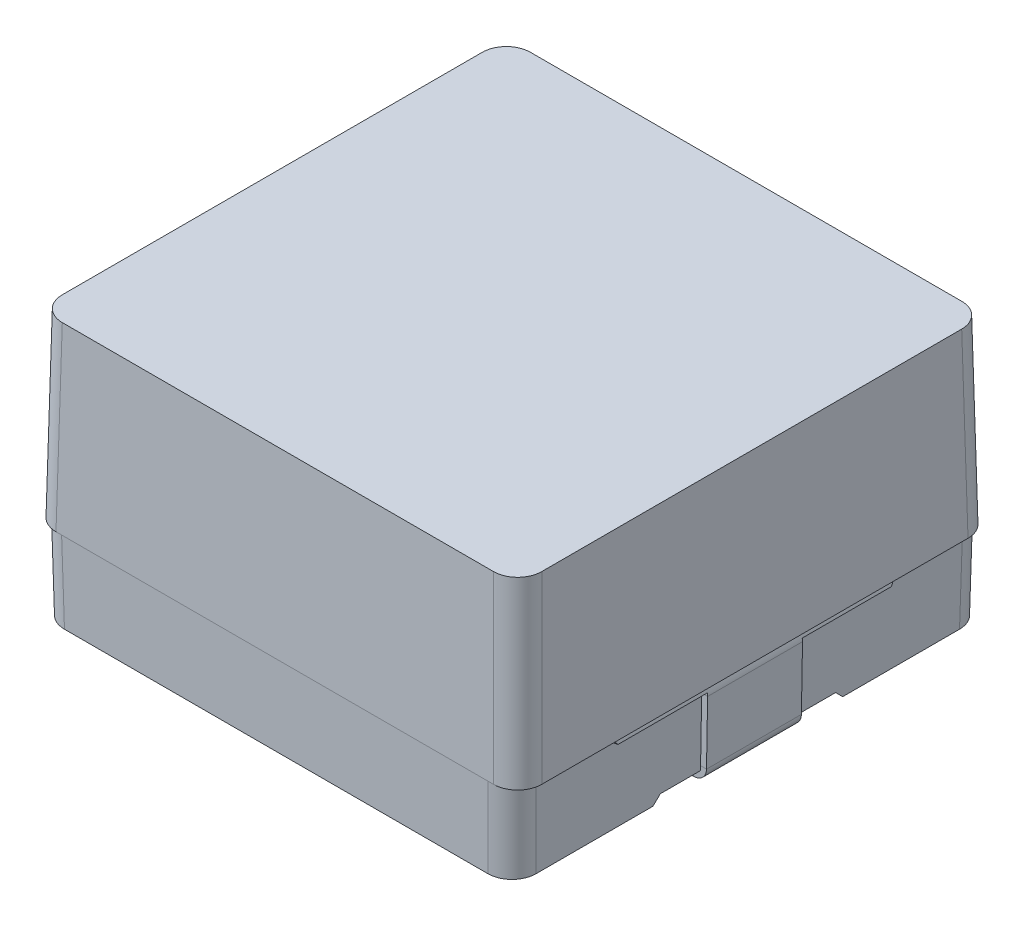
ISO-10303-21;
HEADER;
FILE_DESCRIPTION(('STEP AP214'),'2;1');
FILE_NAME('part.step','',(''),(''),'','','');
FILE_SCHEMA(('AUTOMOTIVE_DESIGN { 1 0 10303 214 1 1 1 1 }'));
ENDSEC;
DATA;
#1=APPLICATION_CONTEXT('core data for automotive mechanical design processes');
#2=APPLICATION_PROTOCOL_DEFINITION('international standard','automotive_design',2000,#1);
#3=PRODUCT_CONTEXT('',#1,'mechanical');
#4=PRODUCT('Part','Part','',(#3));
#5=PRODUCT_RELATED_PRODUCT_CATEGORY('part','',(#4));
#6=PRODUCT_DEFINITION_FORMATION('','',#4);
#7=PRODUCT_DEFINITION_CONTEXT('part definition',#1,'design');
#8=PRODUCT_DEFINITION('design','',#6,#7);
#9=PRODUCT_DEFINITION_SHAPE('','',#8);
#10=(LENGTH_UNIT() NAMED_UNIT(*) SI_UNIT(.MILLI.,.METRE.));
#11=(NAMED_UNIT(*) PLANE_ANGLE_UNIT() SI_UNIT($,.RADIAN.));
#12=(NAMED_UNIT(*) SI_UNIT($,.STERADIAN.) SOLID_ANGLE_UNIT());
#13=UNCERTAINTY_MEASURE_WITH_UNIT(LENGTH_MEASURE(1.E-05),#10,'distance_accuracy_value','');
#14=(GEOMETRIC_REPRESENTATION_CONTEXT(3) GLOBAL_UNCERTAINTY_ASSIGNED_CONTEXT((#13)) GLOBAL_UNIT_ASSIGNED_CONTEXT((#10,
#11,#12)) REPRESENTATION_CONTEXT('',''));
#15=CARTESIAN_POINT('',(0.,0.,0.));
#16=DIRECTION('',(0.,0.,1.));
#17=DIRECTION('',(1.,0.,0.));
#18=AXIS2_PLACEMENT_3D('',#15,#16,#17);
#19=CARTESIAN_POINT('',(-13.422943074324,26.0076555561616,-2.51183097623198));
#20=DIRECTION('',(0.999847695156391,-0.017452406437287,0.));
#21=DIRECTION('',(0.,0.,1.));
#22=AXIS2_PLACEMENT_3D('',#19,#20,#21);
#23=PLANE('',#22);
#24=DIRECTION('',(-0.017452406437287,-0.999847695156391,0.));
#25=VECTOR('',#24,1.);
#26=CARTESIAN_POINT('',(-13.422943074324,26.0076555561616,-4.01043097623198));
#27=LINE('',#26,#25);
#28=CARTESIAN_POINT('',(-13.5932895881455,16.2485103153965,-4.01043097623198));
#29=VERTEX_POINT('',#28);
#30=CARTESIAN_POINT('',(-13.5582697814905,18.2547936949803,-4.01043097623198));
#31=VERTEX_POINT('',#30);
#32=EDGE_CURVE('P0_E33',#29,#31,#27,.F.);
#33=ORIENTED_EDGE('',*,*,#32,.F.);
#34=DIRECTION('',(0.,0.,1.));
#35=VECTOR('',#34,1.);
#36=CARTESIAN_POINT('',(-13.5932895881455,16.2485103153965,-2.51183097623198));
#37=LINE('',#36,#35);
#38=CARTESIAN_POINT('',(-13.5932895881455,16.2485103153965,-1.01323097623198));
#39=VERTEX_POINT('',#38);
#40=EDGE_CURVE('P0_E25',#29,#39,#37,.T.);
#41=ORIENTED_EDGE('',*,*,#40,.T.);
#42=DIRECTION('',(-0.017452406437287,-0.999847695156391,0.));
#43=VECTOR('',#42,1.);
#44=CARTESIAN_POINT('',(-13.422943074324,26.0076555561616,-1.01323097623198));
#45=LINE('',#44,#43);
#46=CARTESIAN_POINT('',(-13.5582697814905,18.2547936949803,-1.01323097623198));
#47=VERTEX_POINT('',#46);
#48=EDGE_CURVE('P0_E41',#39,#47,#45,.F.);
#49=ORIENTED_EDGE('',*,*,#48,.T.);
#50=DIRECTION('',(0.,0.,-1.));
#51=VECTOR('',#50,1.);
#52=CARTESIAN_POINT('',(-13.5582697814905,18.2547936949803,-2.51183097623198));
#53=LINE('',#52,#51);
#54=EDGE_CURVE('P0_E311',#47,#31,#53,.T.);
#55=ORIENTED_EDGE('',*,*,#54,.T.);
#56=EDGE_LOOP('',(#33,#41,#49,#55));
#57=FACE_BOUND('',#56,.T.);
#58=ADVANCED_FACE('P0_F16',(#57),#23,.F.);
#59=CARTESIAN_POINT('',(-28.6398233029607,26.0076555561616,-2.51183097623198));
#60=DIRECTION('',(-0.999847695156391,-0.017452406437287,0.));
#61=DIRECTION('',(0.,0.,1.));
#62=AXIS2_PLACEMENT_3D('',#59,#60,#61);
#63=PLANE('',#62);
#64=DIRECTION('',(-0.017452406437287,0.999847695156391,0.));
#65=VECTOR('',#64,1.);
#66=CARTESIAN_POINT('',(-28.6398233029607,26.0076555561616,-1.01323097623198));
#67=LINE('',#66,#65);
#68=CARTESIAN_POINT('',(-28.5044965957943,18.2547936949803,-1.01323097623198));
#69=VERTEX_POINT('',#68);
#70=CARTESIAN_POINT('',(-28.4694767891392,16.2485103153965,-1.01323097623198));
#71=VERTEX_POINT('',#70);
#72=EDGE_CURVE('P0_E1338',#69,#71,#67,.F.);
#73=ORIENTED_EDGE('',*,*,#72,.T.);
#74=DIRECTION('',(0.,0.,-1.));
#75=VECTOR('',#74,1.);
#76=CARTESIAN_POINT('',(-28.4694767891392,16.2485103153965,-2.51183097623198));
#77=LINE('',#76,#75);
#78=CARTESIAN_POINT('',(-28.4694767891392,16.2485103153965,-4.01043097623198));
#79=VERTEX_POINT('',#78);
#80=EDGE_CURVE('P0_E1213',#71,#79,#77,.T.);
#81=ORIENTED_EDGE('',*,*,#80,.T.);
#82=DIRECTION('',(-0.017452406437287,0.999847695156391,0.));
#83=VECTOR('',#82,1.);
#84=CARTESIAN_POINT('',(-28.6398233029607,26.0076555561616,-4.01043097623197));
#85=LINE('',#84,#83);
#86=CARTESIAN_POINT('',(-28.5044965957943,18.2547936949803,-4.01043097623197));
#87=VERTEX_POINT('',#86);
#88=EDGE_CURVE('P0_E708',#87,#79,#85,.F.);
#89=ORIENTED_EDGE('',*,*,#88,.F.);
#90=DIRECTION('',(0.,0.,-1.));
#91=VECTOR('',#90,1.);
#92=CARTESIAN_POINT('',(-28.5044965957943,18.2547936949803,-2.51183097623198));
#93=LINE('',#92,#91);
#94=EDGE_CURVE('P0_E736',#69,#87,#93,.T.);
#95=ORIENTED_EDGE('',*,*,#94,.F.);
#96=EDGE_LOOP('',(#73,#81,#89,#95));
#97=FACE_BOUND('',#96,.T.);
#98=ADVANCED_FACE('P0_F778',(#97),#63,.F.);
#99=CARTESIAN_POINT('',(-21.0313831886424,18.6647400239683,-2.51183097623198));
#100=DIRECTION('',(0.,1.,0.));
#101=DIRECTION('',(0.,0.,1.));
#102=AXIS2_PLACEMENT_3D('',#99,#100,#101);
#103=PLANE('',#102);
#104=DIRECTION('',(-0.707106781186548,0.,0.707106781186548));
#105=VECTOR('',#104,1.);
#106=CARTESIAN_POINT('',(-15.0306331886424,18.6647400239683,3.48891902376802));
#107=LINE('',#106,#105);
#108=CARTESIAN_POINT('',(-13.7614388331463,18.6647400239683,2.21972466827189));
#109=VERTEX_POINT('',#108);
#110=CARTESIAN_POINT('',(-14.1098831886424,18.6647400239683,2.56816902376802));
#111=VERTEX_POINT('',#110);
#112=EDGE_CURVE('P0_E1282',#109,#111,#107,.T.);
#113=ORIENTED_EDGE('',*,*,#112,.F.);
#114=DIRECTION('',(0.,0.,-1.));
#115=VECTOR('',#114,1.);
#116=CARTESIAN_POINT('',(-13.7614388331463,18.6647400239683,-2.51183097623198));
#117=LINE('',#116,#115);
#118=CARTESIAN_POINT('',(-13.7614388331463,18.6647400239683,-7.24338662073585));
#119=VERTEX_POINT('',#118);
#120=EDGE_CURVE('P0_E741',#109,#119,#117,.T.);
#121=ORIENTED_EDGE('',*,*,#120,.T.);
#122=DIRECTION('',(-0.707106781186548,0.,-0.707106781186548));
#123=VECTOR('',#122,1.);
#124=CARTESIAN_POINT('',(-15.0306331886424,18.6647400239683,-8.51258097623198));
#125=LINE('',#124,#123);
#126=CARTESIAN_POINT('',(-14.1098831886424,18.6647400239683,-7.59183097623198));
#127=VERTEX_POINT('',#126);
#128=EDGE_CURVE('P0_E1311',#119,#127,#125,.T.);
#129=ORIENTED_EDGE('',*,*,#128,.T.);
#130=DIRECTION('',(-1.,0.,0.));
#131=VECTOR('',#130,1.);
#132=CARTESIAN_POINT('',(-21.0313831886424,18.6647400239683,-7.59183097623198));
#133=LINE('',#132,#131);
#134=CARTESIAN_POINT('',(-27.9528831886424,18.6647400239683,-7.59183097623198));
#135=VERTEX_POINT('',#134);
#136=EDGE_CURVE('P0_E726',#127,#135,#133,.T.);
#137=ORIENTED_EDGE('',*,*,#136,.T.);
#138=DIRECTION('',(-0.707106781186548,0.,0.707106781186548));
#139=VECTOR('',#138,1.);
#140=CARTESIAN_POINT('',(-27.0321331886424,18.6647400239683,-8.51258097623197));
#141=LINE('',#140,#139);
#142=CARTESIAN_POINT('',(-28.3013275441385,18.6647400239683,-7.24338662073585));
#143=VERTEX_POINT('',#142);
#144=EDGE_CURVE('P0_E718',#135,#143,#141,.T.);
#145=ORIENTED_EDGE('',*,*,#144,.T.);
#146=DIRECTION('',(0.,0.,-1.));
#147=VECTOR('',#146,1.);
#148=CARTESIAN_POINT('',(-28.3013275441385,18.6647400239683,-2.51183097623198));
#149=LINE('',#148,#147);
#150=CARTESIAN_POINT('',(-28.3013275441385,18.6647400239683,2.21972466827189));
#151=VERTEX_POINT('',#150);
#152=EDGE_CURVE('P0_E1294',#151,#143,#149,.T.);
#153=ORIENTED_EDGE('',*,*,#152,.F.);
#154=DIRECTION('',(-0.707106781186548,0.,-0.707106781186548));
#155=VECTOR('',#154,1.);
#156=CARTESIAN_POINT('',(-27.0321331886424,18.6647400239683,3.48891902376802));
#157=LINE('',#156,#155);
#158=CARTESIAN_POINT('',(-27.9528831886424,18.6647400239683,2.56816902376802));
#159=VERTEX_POINT('',#158);
#160=EDGE_CURVE('P0_E703',#159,#151,#157,.T.);
#161=ORIENTED_EDGE('',*,*,#160,.F.);
#162=DIRECTION('',(-1.,0.,0.));
#163=VECTOR('',#162,1.);
#164=CARTESIAN_POINT('',(-21.0313831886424,18.6647400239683,2.56816902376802));
#165=LINE('',#164,#163);
#166=EDGE_CURVE('P0_E1312',#111,#159,#165,.T.);
#167=ORIENTED_EDGE('',*,*,#166,.F.);
#168=EDGE_LOOP('',(#113,#121,#129,#137,#145,#153,#161,#167));
#169=FACE_BOUND('',#168,.T.);
#170=ADVANCED_FACE('P0_F775',(#169),#103,.T.);
#171=CARTESIAN_POINT('',(-15.0306331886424,18.6647400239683,3.48891902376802));
#172=DIRECTION('',(-0.707106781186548,0.,-0.707106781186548));
#173=DIRECTION('',(-0.707106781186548,0.,0.707106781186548));
#174=AXIS2_PLACEMENT_3D('',#171,#172,#173);
#175=PLANE('',#174);
#176=DIRECTION('',(-0.707106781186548,0.,0.707106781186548));
#177=VECTOR('',#176,1.);
#178=CARTESIAN_POINT('',(-15.0306331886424,18.4615400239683,3.48891902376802));
#179=LINE('',#178,#177);
#180=CARTESIAN_POINT('',(-13.7614388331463,18.4615400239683,2.21972466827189));
#181=VERTEX_POINT('',#180);
#182=CARTESIAN_POINT('',(-14.1098831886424,18.4615400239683,2.56816902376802));
#183=VERTEX_POINT('',#182);
#184=EDGE_CURVE('P0_E698',#181,#183,#179,.T.);
#185=ORIENTED_EDGE('',*,*,#184,.F.);
#186=CARTESIAN_POINT('',(-13.7614388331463,18.6647400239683,2.21972466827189));
#187=CARTESIAN_POINT('',(-13.7614388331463,18.4615400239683,2.21972466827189));
#188=B_SPLINE_CURVE_WITH_KNOTS('',1,(#186,#187),.UNSPECIFIED.,.F.,.F.,(2,2),(0.,1.),.UNSPECIFIED.);
#189=EDGE_CURVE('P0_E745',#181,#109,#188,.F.);
#190=ORIENTED_EDGE('',*,*,#189,.T.);
#191=ORIENTED_EDGE('',*,*,#112,.T.);
#192=DIRECTION('',(0.,1.,0.));
#193=VECTOR('',#192,1.);
#194=CARTESIAN_POINT('',(-14.1098831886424,18.6647400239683,2.56816902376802));
#195=LINE('',#194,#193);
#196=EDGE_CURVE('P0_E1284',#183,#111,#195,.T.);
#197=ORIENTED_EDGE('',*,*,#196,.F.);
#198=EDGE_LOOP('',(#185,#190,#191,#197));
#199=FACE_BOUND('',#198,.T.);
#200=ADVANCED_FACE('P0_F773',(#199),#175,.F.);
#201=CARTESIAN_POINT('',(-15.0306331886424,18.6647400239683,-8.51258097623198));
#202=DIRECTION('',(0.707106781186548,0.,-0.707106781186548));
#203=DIRECTION('',(-0.707106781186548,0.,-0.707106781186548));
#204=AXIS2_PLACEMENT_3D('',#201,#202,#203);
#205=PLANE('',#204);
#206=ORIENTED_EDGE('',*,*,#128,.F.);
#207=CARTESIAN_POINT('',(-13.7614388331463,18.4615400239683,-7.24338662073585));
#208=CARTESIAN_POINT('',(-13.7614388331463,18.6647400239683,-7.24338662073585));
#209=B_SPLINE_CURVE_WITH_KNOTS('',1,(#207,#208),.UNSPECIFIED.,.F.,.F.,(2,2),(0.,1.),.UNSPECIFIED.);
#210=CARTESIAN_POINT('',(-13.7614388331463,18.4615400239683,-7.24338662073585));
#211=VERTEX_POINT('',#210);
#212=EDGE_CURVE('P0_E744',#119,#211,#209,.F.);
#213=ORIENTED_EDGE('',*,*,#212,.T.);
#214=DIRECTION('',(-0.707106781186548,0.,-0.707106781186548));
#215=VECTOR('',#214,1.);
#216=CARTESIAN_POINT('',(-15.0306331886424,18.4615400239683,-8.51258097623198));
#217=LINE('',#216,#215);
#218=CARTESIAN_POINT('',(-14.1098831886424,18.4615400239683,-7.59183097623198));
#219=VERTEX_POINT('',#218);
#220=EDGE_CURVE('P0_E748',#211,#219,#217,.T.);
#221=ORIENTED_EDGE('',*,*,#220,.T.);
#222=DIRECTION('',(0.,1.,0.));
#223=VECTOR('',#222,1.);
#224=CARTESIAN_POINT('',(-14.1098831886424,18.6647400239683,-7.59183097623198));
#225=LINE('',#224,#223);
#226=EDGE_CURVE('P0_E750',#219,#127,#225,.T.);
#227=ORIENTED_EDGE('',*,*,#226,.T.);
#228=EDGE_LOOP('',(#206,#213,#221,#227));
#229=FACE_BOUND('',#228,.T.);
#230=ADVANCED_FACE('P0_F763',(#229),#205,.T.);
#231=CARTESIAN_POINT('',(-28.8429923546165,26.0041092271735,-1.01323097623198));
#232=DIRECTION('',(0.,0.,-1.));
#233=DIRECTION('',(0.017452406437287,-0.999847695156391,0.));
#234=AXIS2_PLACEMENT_3D('',#231,#232,#233);
#235=PLANE('',#234);
#236=DIRECTION('',(-0.999847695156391,-0.017452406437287,0.));
#237=VECTOR('',#236,1.);
#238=CARTESIAN_POINT('',(-28.672645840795,16.2449639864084,-1.01323097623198));
#239=LINE('',#238,#237);
#240=CARTESIAN_POINT('',(-28.672645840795,16.2449639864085,-1.01323097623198));
#241=VERTEX_POINT('',#240);
#242=EDGE_CURVE('P0_E1209',#71,#241,#239,.T.);
#243=ORIENTED_EDGE('',*,*,#242,.F.);
#244=ORIENTED_EDGE('',*,*,#72,.F.);
#245=DIRECTION('',(-0.999847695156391,-0.017452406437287,0.));
#246=VECTOR('',#245,1.);
#247=CARTESIAN_POINT('',(-28.7076656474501,18.2512473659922,-1.01323097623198));
#248=LINE('',#247,#246);
#249=CARTESIAN_POINT('',(-28.7076656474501,18.2512473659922,-1.01323097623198));
#250=VERTEX_POINT('',#249);
#251=EDGE_CURVE('P0_E732',#69,#250,#248,.T.);
#252=ORIENTED_EDGE('',*,*,#251,.T.);
#253=DIRECTION('',(0.017452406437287,-0.999847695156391,0.));
#254=VECTOR('',#253,1.);
#255=CARTESIAN_POINT('',(-28.8429923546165,26.0041092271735,-1.01323097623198));
#256=LINE('',#255,#254);
#257=EDGE_CURVE('P0_E733',#250,#241,#256,.T.);
#258=ORIENTED_EDGE('',*,*,#257,.T.);
#259=EDGE_LOOP('',(#243,#244,#252,#258));
#260=FACE_BOUND('',#259,.T.);
#261=ADVANCED_FACE('P0_F772',(#260),#235,.F.);
#262=CARTESIAN_POINT('',(-28.8429923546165,26.0041092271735,-4.01043097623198));
#263=DIRECTION('',(0.,0.,-1.));
#264=DIRECTION('',(0.017452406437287,-0.999847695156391,0.));
#265=AXIS2_PLACEMENT_3D('',#262,#263,#264);
#266=PLANE('',#265);
#267=DIRECTION('',(0.999847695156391,0.017452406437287,0.));
#268=VECTOR('',#267,1.);
#269=CARTESIAN_POINT('',(-28.672645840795,16.2449639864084,-4.01043097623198));
#270=LINE('',#269,#268);
#271=CARTESIAN_POINT('',(-28.672645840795,16.2449639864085,-4.01043097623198));
#272=VERTEX_POINT('',#271);
#273=EDGE_CURVE('P0_E1332',#272,#79,#270,.T.);
#274=ORIENTED_EDGE('',*,*,#273,.F.);
#275=DIRECTION('',(0.017452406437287,-0.999847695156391,0.));
#276=VECTOR('',#275,1.);
#277=CARTESIAN_POINT('',(-28.8429923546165,26.0041092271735,-4.01043097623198));
#278=LINE('',#277,#276);
#279=CARTESIAN_POINT('',(-28.7076656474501,18.2512473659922,-4.01043097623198));
#280=VERTEX_POINT('',#279);
#281=EDGE_CURVE('P0_E1216',#280,#272,#278,.T.);
#282=ORIENTED_EDGE('',*,*,#281,.F.);
#283=DIRECTION('',(0.999847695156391,0.017452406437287,0.));
#284=VECTOR('',#283,1.);
#285=CARTESIAN_POINT('',(-28.7076656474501,18.2512473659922,-4.01043097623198));
#286=LINE('',#285,#284);
#287=EDGE_CURVE('P0_E738',#280,#87,#286,.T.);
#288=ORIENTED_EDGE('',*,*,#287,.T.);
#289=ORIENTED_EDGE('',*,*,#88,.T.);
#290=EDGE_LOOP('',(#274,#282,#288,#289));
#291=FACE_BOUND('',#290,.T.);
#292=ADVANCED_FACE('P0_F785',(#291),#266,.T.);
#293=CARTESIAN_POINT('',(-28.8429923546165,26.0041092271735,-2.51183097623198));
#294=DIRECTION('',(-0.999847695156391,-0.017452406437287,0.));
#295=DIRECTION('',(0.,0.,1.));
#296=AXIS2_PLACEMENT_3D('',#293,#294,#295);
#297=PLANE('',#296);
#298=DIRECTION('',(0.,0.,-1.));
#299=VECTOR('',#298,1.);
#300=CARTESIAN_POINT('',(-28.672645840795,16.2449639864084,-2.51183097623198));
#301=LINE('',#300,#299);
#302=EDGE_CURVE('P0_E1329',#241,#272,#301,.T.);
#303=ORIENTED_EDGE('',*,*,#302,.F.);
#304=ORIENTED_EDGE('',*,*,#257,.F.);
#305=DIRECTION('',(0.,0.,-1.));
#306=VECTOR('',#305,1.);
#307=CARTESIAN_POINT('',(-28.7076656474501,18.2512473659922,-2.51183097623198));
#308=LINE('',#307,#306);
#309=EDGE_CURVE('P0_E729',#250,#280,#308,.T.);
#310=ORIENTED_EDGE('',*,*,#309,.T.);
#311=ORIENTED_EDGE('',*,*,#281,.T.);
#312=EDGE_LOOP('',(#303,#304,#310,#311));
#313=FACE_BOUND('',#312,.T.);
#314=ADVANCED_FACE('P0_F671',(#313),#297,.T.);
#315=CARTESIAN_POINT('',(-21.0313831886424,18.6647400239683,-7.59183097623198));
#316=DIRECTION('',(0.,0.,-1.));
#317=DIRECTION('',(-1.,0.,0.));
#318=AXIS2_PLACEMENT_3D('',#315,#316,#317);
#319=PLANE('',#318);
#320=ORIENTED_EDGE('',*,*,#226,.F.);
#321=DIRECTION('',(1.,0.,0.));
#322=VECTOR('',#321,1.);
#323=CARTESIAN_POINT('',(-21.0313831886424,18.4615400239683,-7.59183097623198));
#324=LINE('',#323,#322);
#325=CARTESIAN_POINT('',(-27.9528831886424,18.4615400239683,-7.59183097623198));
#326=VERTEX_POINT('',#325);
#327=EDGE_CURVE('P0_E1277',#219,#326,#324,.F.);
#328=ORIENTED_EDGE('',*,*,#327,.T.);
#329=DIRECTION('',(0.,1.,0.));
#330=VECTOR('',#329,1.);
#331=CARTESIAN_POINT('',(-27.9528831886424,18.6647400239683,-7.59183097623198));
#332=LINE('',#331,#330);
#333=EDGE_CURVE('P0_E751',#326,#135,#332,.T.);
#334=ORIENTED_EDGE('',*,*,#333,.T.);
#335=ORIENTED_EDGE('',*,*,#136,.F.);
#336=EDGE_LOOP('',(#320,#328,#334,#335));
#337=FACE_BOUND('',#336,.T.);
#338=ADVANCED_FACE('P0_F667',(#337),#319,.T.);
#339=CARTESIAN_POINT('',(-21.0313831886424,18.6647400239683,2.56816902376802));
#340=DIRECTION('',(0.,0.,-1.));
#341=DIRECTION('',(-1.,0.,0.));
#342=AXIS2_PLACEMENT_3D('',#339,#340,#341);
#343=PLANE('',#342);
#344=DIRECTION('',(0.,1.,0.));
#345=VECTOR('',#344,1.);
#346=CARTESIAN_POINT('',(-27.9528831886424,18.6647400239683,2.56816902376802));
#347=LINE('',#346,#345);
#348=CARTESIAN_POINT('',(-27.9528831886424,18.4615400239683,2.56816902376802));
#349=VERTEX_POINT('',#348);
#350=EDGE_CURVE('P0_E725',#349,#159,#347,.T.);
#351=ORIENTED_EDGE('',*,*,#350,.F.);
#352=DIRECTION('',(1.,0.,0.));
#353=VECTOR('',#352,1.);
#354=CARTESIAN_POINT('',(-21.0313831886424,18.4615400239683,2.56816902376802));
#355=LINE('',#354,#353);
#356=EDGE_CURVE('P0_E709',#183,#349,#355,.F.);
#357=ORIENTED_EDGE('',*,*,#356,.F.);
#358=ORIENTED_EDGE('',*,*,#196,.T.);
#359=ORIENTED_EDGE('',*,*,#166,.T.);
#360=EDGE_LOOP('',(#351,#357,#358,#359));
#361=FACE_BOUND('',#360,.T.);
#362=ADVANCED_FACE('P0_F670',(#361),#343,.F.);
#363=CARTESIAN_POINT('',(-27.0321331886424,18.6647400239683,3.48891902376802));
#364=DIRECTION('',(0.707106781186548,0.,-0.707106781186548));
#365=DIRECTION('',(-0.707106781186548,0.,-0.707106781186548));
#366=AXIS2_PLACEMENT_3D('',#363,#364,#365);
#367=PLANE('',#366);
#368=CARTESIAN_POINT('',(-28.3013275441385,18.4615400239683,2.21972466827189));
#369=CARTESIAN_POINT('',(-28.3013275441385,18.6647400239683,2.21972466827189));
#370=B_SPLINE_CURVE_WITH_KNOTS('',1,(#368,#369),.UNSPECIFIED.,.F.,.F.,(2,2),(0.,1.),.UNSPECIFIED.);
#371=CARTESIAN_POINT('',(-28.3013275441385,18.4615400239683,2.21972466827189));
#372=VERTEX_POINT('',#371);
#373=EDGE_CURVE('P0_E630',#372,#151,#370,.T.);
#374=ORIENTED_EDGE('',*,*,#373,.F.);
#375=DIRECTION('',(-0.707106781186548,0.,-0.707106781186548));
#376=VECTOR('',#375,1.);
#377=CARTESIAN_POINT('',(-27.0321331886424,18.4615400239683,3.48891902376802));
#378=LINE('',#377,#376);
#379=EDGE_CURVE('P0_E699',#349,#372,#378,.T.);
#380=ORIENTED_EDGE('',*,*,#379,.F.);
#381=ORIENTED_EDGE('',*,*,#350,.T.);
#382=ORIENTED_EDGE('',*,*,#160,.T.);
#383=EDGE_LOOP('',(#374,#380,#381,#382));
#384=FACE_BOUND('',#383,.T.);
#385=ADVANCED_FACE('P0_F675',(#384),#367,.F.);
#386=CARTESIAN_POINT('',(-21.0313831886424,18.4615400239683,-2.51183097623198));
#387=DIRECTION('',(0.,1.,0.));
#388=DIRECTION('',(0.,0.,1.));
#389=AXIS2_PLACEMENT_3D('',#386,#387,#388);
#390=PLANE('',#389);
#391=DIRECTION('',(0.,0.,-1.));
#392=VECTOR('',#391,1.);
#393=CARTESIAN_POINT('',(-13.7614388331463,18.4615400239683,-2.51183097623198));
#394=LINE('',#393,#392);
#395=EDGE_CURVE('P0_E742',#181,#211,#394,.T.);
#396=ORIENTED_EDGE('',*,*,#395,.F.);
#397=ORIENTED_EDGE('',*,*,#184,.T.);
#398=ORIENTED_EDGE('',*,*,#356,.T.);
#399=ORIENTED_EDGE('',*,*,#379,.T.);
#400=DIRECTION('',(0.,0.,-1.));
#401=VECTOR('',#400,1.);
#402=CARTESIAN_POINT('',(-28.3013275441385,18.4615400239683,-2.51183097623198));
#403=LINE('',#402,#401);
#404=CARTESIAN_POINT('',(-28.3013275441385,18.4615400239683,-7.24338662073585));
#405=VERTEX_POINT('',#404);
#406=EDGE_CURVE('P0_E690',#372,#405,#403,.T.);
#407=ORIENTED_EDGE('',*,*,#406,.T.);
#408=DIRECTION('',(-0.707106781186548,0.,0.707106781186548));
#409=VECTOR('',#408,1.);
#410=CARTESIAN_POINT('',(-27.0321331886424,18.4615400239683,-8.51258097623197));
#411=LINE('',#410,#409);
#412=EDGE_CURVE('P0_E706',#326,#405,#411,.T.);
#413=ORIENTED_EDGE('',*,*,#412,.F.);
#414=ORIENTED_EDGE('',*,*,#327,.F.);
#415=ORIENTED_EDGE('',*,*,#220,.F.);
#416=EDGE_LOOP('',(#396,#397,#398,#399,#407,#413,#414,#415));
#417=FACE_BOUND('',#416,.T.);
#418=ADVANCED_FACE('P0_F680',(#417),#390,.F.);
#419=CARTESIAN_POINT('',(-27.0321331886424,18.6647400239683,-8.51258097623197));
#420=DIRECTION('',(-0.707106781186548,0.,-0.707106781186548));
#421=DIRECTION('',(-0.707106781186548,0.,0.707106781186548));
#422=AXIS2_PLACEMENT_3D('',#419,#420,#421);
#423=PLANE('',#422);
#424=CARTESIAN_POINT('',(-28.3013275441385,18.6647400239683,-7.24338662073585));
#425=CARTESIAN_POINT('',(-28.3013275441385,18.4615400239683,-7.24338662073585));
#426=B_SPLINE_CURVE_WITH_KNOTS('',1,(#424,#425),.UNSPECIFIED.,.F.,.F.,(2,2),(0.,1.),.UNSPECIFIED.);
#427=EDGE_CURVE('P0_E615',#143,#405,#426,.T.);
#428=ORIENTED_EDGE('',*,*,#427,.F.);
#429=ORIENTED_EDGE('',*,*,#144,.F.);
#430=ORIENTED_EDGE('',*,*,#333,.F.);
#431=ORIENTED_EDGE('',*,*,#412,.T.);
#432=EDGE_LOOP('',(#428,#429,#430,#431));
#433=FACE_BOUND('',#432,.T.);
#434=ADVANCED_FACE('P0_F662',(#433),#423,.T.);
#435=CARTESIAN_POINT('',(-28.3013275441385,18.2583400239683,-1.01323097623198));
#436=DIRECTION('',(0.,0.,1.));
#437=DIRECTION('',(1.,0.,0.));
#438=AXIS2_PLACEMENT_3D('',#435,#436,#437);
#439=PLANE('',#438);
#440=ORIENTED_EDGE('',*,*,#251,.F.);
#441=CARTESIAN_POINT('',(-28.3013275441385,18.2583400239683,-1.01323097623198));
#442=DIRECTION('',(0.,0.,1.));
#443=DIRECTION('',(1.,0.,0.));
#444=AXIS2_PLACEMENT_3D('',#441,#442,#443);
#445=CIRCLE('',#444,0.2032);
#446=CARTESIAN_POINT('',(-28.4998929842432,18.3014909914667,-1.01323097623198));
#447=VERTEX_POINT('',#446);
#448=EDGE_CURVE('P0_E467',#69,#447,#445,.F.);
#449=ORIENTED_EDGE('',*,*,#448,.T.);
#450=DIRECTION('',(-0.977192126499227,0.212357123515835,0.));
#451=VECTOR('',#450,1.);
#452=CARTESIAN_POINT('',(-28.6984584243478,18.3446419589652,-1.01323097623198));
#453=LINE('',#452,#451);
#454=CARTESIAN_POINT('',(-28.6984584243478,18.3446419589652,-1.01323097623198));
#455=VERTEX_POINT('',#454);
#456=EDGE_CURVE('P0_E1295',#447,#455,#453,.T.);
#457=ORIENTED_EDGE('',*,*,#456,.T.);
#458=CARTESIAN_POINT('',(-28.3013275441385,18.2583400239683,-1.01323097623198));
#459=DIRECTION('',(0.,0.,-1.));
#460=DIRECTION('',(1.,0.,0.));
#461=AXIS2_PLACEMENT_3D('',#458,#459,#460);
#462=CIRCLE('',#461,0.4064);
#463=EDGE_CURVE('P0_E490',#250,#455,#462,.T.);
#464=ORIENTED_EDGE('',*,*,#463,.F.);
#465=EDGE_LOOP('',(#440,#449,#457,#464));
#466=FACE_BOUND('',#465,.T.);
#467=ADVANCED_FACE('P0_F659',(#466),#439,.T.);
#468=CARTESIAN_POINT('',(-28.6984584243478,18.3446419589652,0.396469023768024));
#469=DIRECTION('',(-0.212357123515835,-0.977192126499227,0.));
#470=DIRECTION('',(0.,0.,1.));
#471=AXIS2_PLACEMENT_3D('',#468,#469,#470);
#472=PLANE('',#471);
#473=ORIENTED_EDGE('',*,*,#456,.F.);
#474=DIRECTION('',(0.,0.,1.));
#475=VECTOR('',#474,1.);
#476=CARTESIAN_POINT('',(-28.4998929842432,18.3014909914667,-11.9894950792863));
#477=LINE('',#476,#475);
#478=CARTESIAN_POINT('',(-28.4998929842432,18.3014909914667,1.80616902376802));
#479=VERTEX_POINT('',#478);
#480=EDGE_CURVE('P0_E1366',#447,#479,#477,.T.);
#481=ORIENTED_EDGE('',*,*,#480,.T.);
#482=CARTESIAN_POINT('',(-28.6984584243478,18.3446419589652,1.80616902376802));
#483=CARTESIAN_POINT('',(-28.4998929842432,18.3014909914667,1.80616902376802));
#484=B_SPLINE_CURVE_WITH_KNOTS('',1,(#482,#483),.UNSPECIFIED.,.F.,.F.,(2,2),(0.,1.),.UNSPECIFIED.);
#485=CARTESIAN_POINT('',(-28.6984584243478,18.3446419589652,1.80616902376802));
#486=VERTEX_POINT('',#485);
#487=EDGE_CURVE('P0_E644',#479,#486,#484,.F.);
#488=ORIENTED_EDGE('',*,*,#487,.T.);
#489=DIRECTION('',(0.,0.,1.));
#490=VECTOR('',#489,1.);
#491=CARTESIAN_POINT('',(-28.6984584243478,18.3446419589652,1.80616902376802));
#492=LINE('',#491,#490);
#493=EDGE_CURVE('P0_E1405',#455,#486,#492,.T.);
#494=ORIENTED_EDGE('',*,*,#493,.F.);
#495=EDGE_LOOP('',(#473,#481,#488,#494));
#496=FACE_BOUND('',#495,.T.);
#497=ADVANCED_FACE('P0_F650',(#496),#472,.T.);
#498=CARTESIAN_POINT('',(-28.6984584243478,18.3446419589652,1.80616902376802));
#499=CARTESIAN_POINT('',(-28.6789228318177,18.4345378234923,1.87516456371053));
#500=CARTESIAN_POINT('',(-28.6279166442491,18.5170799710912,1.94402090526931));
#501=CARTESIAN_POINT('',(-28.4848126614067,18.6324255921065,2.0818727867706));
#502=CARTESIAN_POINT('',(-28.3933215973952,18.6647400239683,2.15072912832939));
#503=CARTESIAN_POINT('',(-28.3013275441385,18.6647400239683,2.21972466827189));
#504=CARTESIAN_POINT('',(-28.4998929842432,18.3014909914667,1.80616902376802));
#505=CARTESIAN_POINT('',(-28.4901303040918,18.3464153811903,1.8751284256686));
#506=CARTESIAN_POINT('',(-28.4646220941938,18.3877099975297,1.94402090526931));
#507=CARTESIAN_POINT('',(-28.3930701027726,18.4453828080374,2.0818727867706));
#508=CARTESIAN_POINT('',(-28.3473004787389,18.4615400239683,2.15076526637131));
#509=CARTESIAN_POINT('',(-28.3013275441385,18.4615400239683,2.21972466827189));
#510=B_SPLINE_SURFACE_WITH_KNOTS('',1,3,((#498,#499,#500,#501,#502,#503),(#504,#505,#506,#507,
#508,#509)),.UNSPECIFIED.,.F.,.F.,.F.,(2,2),(4,2,4),(0.,1.),(0.,0.5,1.),.UNSPECIFIED.);
#511=CARTESIAN_POINT('',(-28.4998929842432,18.3014909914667,1.80616902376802));
#512=CARTESIAN_POINT('',(-28.4901303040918,18.3464153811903,1.8751284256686));
#513=CARTESIAN_POINT('',(-28.4646220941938,18.3877099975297,1.94402090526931));
#514=CARTESIAN_POINT('',(-28.3930701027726,18.4453828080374,2.0818727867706));
#515=CARTESIAN_POINT('',(-28.3473004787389,18.4615400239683,2.15076526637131));
#516=CARTESIAN_POINT('',(-28.3013275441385,18.4615400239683,2.21972466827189));
#517=B_SPLINE_CURVE_WITH_KNOTS('',3,(#511,#512,#513,#514,#515,#516),.UNSPECIFIED.,.F.,.F.,(4,2,
4),(0.,0.5,1.),.UNSPECIFIED.);
#518=EDGE_CURVE('P0_E1368',#479,#372,#517,.T.);
#519=CARTESIAN_POINT('',(-28.3013275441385,18.6647400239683,2.21972466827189));
#520=CARTESIAN_POINT('',(-28.3933215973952,18.6647400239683,2.15072912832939));
#521=CARTESIAN_POINT('',(-28.4848126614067,18.6324255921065,2.0818727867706));
#522=CARTESIAN_POINT('',(-28.6279166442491,18.5170799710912,1.94402090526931));
#523=CARTESIAN_POINT('',(-28.6789228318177,18.4345378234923,1.87516456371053));
#524=CARTESIAN_POINT('',(-28.6984584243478,18.3446419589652,1.80616902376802));
#525=B_SPLINE_CURVE_WITH_KNOTS('',3,(#519,#520,#521,#522,#523,#524),.UNSPECIFIED.,.F.,.F.,(4,2,
4),(0.,0.5,1.),.UNSPECIFIED.);
#526=EDGE_CURVE('P0_E1392',#486,#151,#525,.F.);
#527=ORIENTED_EDGE('',*,*,#487,.F.);
#528=ORIENTED_EDGE('',*,*,#518,.T.);
#529=ORIENTED_EDGE('',*,*,#373,.T.);
#530=ORIENTED_EDGE('',*,*,#526,.F.);
#531=EDGE_LOOP('',(#527,#528,#529,#530));
#532=FACE_BOUND('',#531,.T.);
#533=ADVANCED_FACE('P0_F574',(#532),#510,.T.);
#534=CARTESIAN_POINT('',(-28.3013275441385,18.6647400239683,-7.24338662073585));
#535=CARTESIAN_POINT('',(-28.3933215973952,18.6647400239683,-7.17439108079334));
#536=CARTESIAN_POINT('',(-28.4848126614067,18.6324255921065,-7.10553473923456));
#537=CARTESIAN_POINT('',(-28.6279166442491,18.5170799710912,-6.96768285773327));
#538=CARTESIAN_POINT('',(-28.6789228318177,18.4345378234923,-6.89882651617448));
#539=CARTESIAN_POINT('',(-28.6984584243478,18.3446419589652,-6.82983097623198));
#540=CARTESIAN_POINT('',(-28.3013275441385,18.4615400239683,-7.24338662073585));
#541=CARTESIAN_POINT('',(-28.3473004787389,18.4615400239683,-7.17442721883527));
#542=CARTESIAN_POINT('',(-28.3930701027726,18.4453828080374,-7.10553473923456));
#543=CARTESIAN_POINT('',(-28.4646220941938,18.3877099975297,-6.96768285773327));
#544=CARTESIAN_POINT('',(-28.4901303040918,18.3464153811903,-6.89879037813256));
#545=CARTESIAN_POINT('',(-28.4998929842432,18.3014909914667,-6.82983097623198));
#546=B_SPLINE_SURFACE_WITH_KNOTS('',1,3,((#534,#535,#536,#537,#538,#539),(#540,#541,#542,#543,
#544,#545)),.UNSPECIFIED.,.F.,.F.,.F.,(2,2),(4,2,4),(0.,1.),(0.,0.5,1.),.UNSPECIFIED.);
#547=CARTESIAN_POINT('',(-28.3013275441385,18.4615400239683,-7.24338662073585));
#548=CARTESIAN_POINT('',(-28.3473004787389,18.4615400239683,-7.17442721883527));
#549=CARTESIAN_POINT('',(-28.3930701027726,18.4453828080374,-7.10553473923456));
#550=CARTESIAN_POINT('',(-28.4646220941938,18.3877099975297,-6.96768285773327));
#551=CARTESIAN_POINT('',(-28.4901303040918,18.3464153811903,-6.89879037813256));
#552=CARTESIAN_POINT('',(-28.4998929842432,18.3014909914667,-6.82983097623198));
#553=B_SPLINE_CURVE_WITH_KNOTS('',3,(#547,#548,#549,#550,#551,#552),.UNSPECIFIED.,.F.,.F.,(4,2,
4),(0.,0.5,1.),.UNSPECIFIED.);
#554=CARTESIAN_POINT('',(-28.4998929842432,18.3014909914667,-6.82983097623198));
#555=VERTEX_POINT('',#554);
#556=EDGE_CURVE('P0_E546',#405,#555,#553,.T.);
#557=CARTESIAN_POINT('',(-28.4998929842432,18.3014909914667,-6.82983097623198));
#558=CARTESIAN_POINT('',(-28.6984584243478,18.3446419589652,-6.82983097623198));
#559=B_SPLINE_CURVE_WITH_KNOTS('',1,(#557,#558),.UNSPECIFIED.,.F.,.F.,(2,2),(0.,1.),.UNSPECIFIED.);
#560=CARTESIAN_POINT('',(-28.6984584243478,18.3446419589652,-6.82983097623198));
#561=VERTEX_POINT('',#560);
#562=EDGE_CURVE('P0_E605',#555,#561,#559,.T.);
#563=CARTESIAN_POINT('',(-28.6984584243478,18.3446419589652,-6.82983097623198));
#564=CARTESIAN_POINT('',(-28.6789228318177,18.4345378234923,-6.89882651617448));
#565=CARTESIAN_POINT('',(-28.6279166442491,18.5170799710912,-6.96768285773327));
#566=CARTESIAN_POINT('',(-28.4848126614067,18.6324255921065,-7.10553473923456));
#567=CARTESIAN_POINT('',(-28.3933215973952,18.6647400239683,-7.17439108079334));
#568=CARTESIAN_POINT('',(-28.3013275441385,18.6647400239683,-7.24338662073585));
#569=B_SPLINE_CURVE_WITH_KNOTS('',3,(#563,#564,#565,#566,#567,#568),.UNSPECIFIED.,.F.,.F.,(4,2,
4),(0.,0.5,1.),.UNSPECIFIED.);
#570=EDGE_CURVE('P0_E537',#143,#561,#569,.F.);
#571=ORIENTED_EDGE('',*,*,#427,.T.);
#572=ORIENTED_EDGE('',*,*,#556,.T.);
#573=ORIENTED_EDGE('',*,*,#562,.T.);
#574=ORIENTED_EDGE('',*,*,#570,.F.);
#575=EDGE_LOOP('',(#571,#572,#573,#574));
#576=FACE_BOUND('',#575,.T.);
#577=ADVANCED_FACE('P0_F562',(#576),#546,.T.);
#578=CARTESIAN_POINT('',(-28.6984584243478,18.3446419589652,-5.42013097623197));
#579=DIRECTION('',(-0.212357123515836,-0.977192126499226,0.));
#580=DIRECTION('',(0.,0.,1.));
#581=AXIS2_PLACEMENT_3D('',#578,#579,#580);
#582=PLANE('',#581);
#583=ORIENTED_EDGE('',*,*,#562,.F.);
#584=DIRECTION('',(0.,0.,1.));
#585=VECTOR('',#584,1.);
#586=CARTESIAN_POINT('',(-28.4998929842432,18.3014909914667,-11.9894950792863));
#587=LINE('',#586,#585);
#588=CARTESIAN_POINT('',(-28.4998929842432,18.3014909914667,-4.01043097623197));
#589=VERTEX_POINT('',#588);
#590=EDGE_CURVE('P0_E1372',#555,#589,#587,.T.);
#591=ORIENTED_EDGE('',*,*,#590,.T.);
#592=DIRECTION('',(-0.977192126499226,0.212357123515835,0.));
#593=VECTOR('',#592,1.);
#594=CARTESIAN_POINT('',(-28.6984584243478,18.3446419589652,-4.01043097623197));
#595=LINE('',#594,#593);
#596=CARTESIAN_POINT('',(-28.6984584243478,18.3446419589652,-4.01043097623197));
#597=VERTEX_POINT('',#596);
#598=EDGE_CURVE('P0_E1305',#589,#597,#595,.T.);
#599=ORIENTED_EDGE('',*,*,#598,.T.);
#600=DIRECTION('',(0.,0.,1.));
#601=VECTOR('',#600,1.);
#602=CARTESIAN_POINT('',(-28.6984584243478,18.3446419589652,-4.01043097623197));
#603=LINE('',#602,#601);
#604=EDGE_CURVE('P0_E524',#561,#597,#603,.T.);
#605=ORIENTED_EDGE('',*,*,#604,.F.);
#606=EDGE_LOOP('',(#583,#591,#599,#605));
#607=FACE_BOUND('',#606,.T.);
#608=ADVANCED_FACE('P0_F573',(#607),#582,.T.);
#609=CARTESIAN_POINT('',(-28.3013275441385,18.2583400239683,-4.01043097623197));
#610=DIRECTION('',(0.,0.,-1.));
#611=DIRECTION('',(-1.,0.,0.));
#612=AXIS2_PLACEMENT_3D('',#609,#610,#611);
#613=PLANE('',#612);
#614=CARTESIAN_POINT('',(-28.3013275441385,18.2583400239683,-4.01043097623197));
#615=DIRECTION('',(0.,0.,1.));
#616=DIRECTION('',(1.,0.,0.));
#617=AXIS2_PLACEMENT_3D('',#614,#615,#616);
#618=CIRCLE('',#617,0.2032);
#619=EDGE_CURVE('P0_E1371',#589,#87,#618,.T.);
#620=ORIENTED_EDGE('',*,*,#619,.T.);
#621=ORIENTED_EDGE('',*,*,#287,.F.);
#622=CARTESIAN_POINT('',(-28.3013275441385,18.2583400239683,-4.01043097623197));
#623=DIRECTION('',(0.,0.,1.));
#624=DIRECTION('',(1.,0.,0.));
#625=AXIS2_PLACEMENT_3D('',#622,#623,#624);
#626=CIRCLE('',#625,0.4064);
#627=EDGE_CURVE('P0_E1307',#597,#280,#626,.T.);
#628=ORIENTED_EDGE('',*,*,#627,.F.);
#629=ORIENTED_EDGE('',*,*,#598,.F.);
#630=EDGE_LOOP('',(#620,#621,#628,#629));
#631=FACE_BOUND('',#630,.T.);
#632=ADVANCED_FACE('P0_F507',(#631),#613,.T.);
#633=CARTESIAN_POINT('',(-28.3013275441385,18.2583400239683,-11.9894950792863));
#634=DIRECTION('',(0.,0.,1.));
#635=DIRECTION('',(1.,0.,0.));
#636=AXIS2_PLACEMENT_3D('',#633,#634,#635);
#637=CYLINDRICAL_SURFACE('',#636,0.4064);
#638=ORIENTED_EDGE('',*,*,#604,.T.);
#639=ORIENTED_EDGE('',*,*,#627,.T.);
#640=ORIENTED_EDGE('',*,*,#309,.F.);
#641=ORIENTED_EDGE('',*,*,#463,.T.);
#642=ORIENTED_EDGE('',*,*,#493,.T.);
#643=ORIENTED_EDGE('',*,*,#526,.T.);
#644=ORIENTED_EDGE('',*,*,#152,.T.);
#645=ORIENTED_EDGE('',*,*,#570,.T.);
#646=EDGE_LOOP('',(#638,#639,#640,#641,#642,#643,#644,#645));
#647=FACE_BOUND('',#646,.T.);
#648=ADVANCED_FACE('P0_F502',(#647),#637,.T.);
#649=CARTESIAN_POINT('',(-28.3013275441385,18.2583400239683,-11.9894950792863));
#650=DIRECTION('',(0.,0.,1.));
#651=DIRECTION('',(1.,0.,0.));
#652=AXIS2_PLACEMENT_3D('',#649,#650,#651);
#653=CYLINDRICAL_SURFACE('',#652,0.2032);
#654=ORIENTED_EDGE('',*,*,#590,.F.);
#655=ORIENTED_EDGE('',*,*,#556,.F.);
#656=ORIENTED_EDGE('',*,*,#406,.F.);
#657=ORIENTED_EDGE('',*,*,#518,.F.);
#658=ORIENTED_EDGE('',*,*,#480,.F.);
#659=ORIENTED_EDGE('',*,*,#448,.F.);
#660=ORIENTED_EDGE('',*,*,#94,.T.);
#661=ORIENTED_EDGE('',*,*,#619,.F.);
#662=EDGE_LOOP('',(#654,#655,#656,#657,#658,#659,#660,#661));
#663=FACE_BOUND('',#662,.T.);
#664=ADVANCED_FACE('P0_F506',(#663),#653,.F.);
#665=CARTESIAN_POINT('',(-13.7614388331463,18.2583400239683,-1.01323097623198));
#666=DIRECTION('',(0.,0.,1.));
#667=DIRECTION('',(1.,0.,0.));
#668=AXIS2_PLACEMENT_3D('',#665,#666,#667);
#669=PLANE('',#668);
#670=DIRECTION('',(0.977192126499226,0.212357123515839,0.));
#671=VECTOR('',#670,1.);
#672=CARTESIAN_POINT('',(-13.364307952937,18.3446419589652,-1.01323097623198));
#673=LINE('',#672,#671);
#674=CARTESIAN_POINT('',(-13.5628733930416,18.3014909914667,-1.01323097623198));
#675=VERTEX_POINT('',#674);
#676=CARTESIAN_POINT('',(-13.364307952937,18.3446419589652,-1.01323097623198));
#677=VERTEX_POINT('',#676);
#678=EDGE_CURVE('P0_E465',#675,#677,#673,.T.);
#679=ORIENTED_EDGE('',*,*,#678,.F.);
#680=CARTESIAN_POINT('',(-13.7614388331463,18.2583400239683,-1.01323097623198));
#681=DIRECTION('',(0.,0.,-1.));
#682=DIRECTION('',(-1.,0.,0.));
#683=AXIS2_PLACEMENT_3D('',#680,#681,#682);
#684=CIRCLE('',#683,0.2032);
#685=EDGE_CURVE('P0_E1221',#675,#47,#684,.T.);
#686=ORIENTED_EDGE('',*,*,#685,.T.);
#687=DIRECTION('',(0.999847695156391,-0.017452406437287,0.));
#688=VECTOR('',#687,1.);
#689=CARTESIAN_POINT('',(-13.3551007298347,18.2512473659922,-1.01323097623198));
#690=LINE('',#689,#688);
#691=CARTESIAN_POINT('',(-13.3551007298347,18.2512473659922,-1.01323097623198));
#692=VERTEX_POINT('',#691);
#693=EDGE_CURVE('P0_E313',#47,#692,#690,.T.);
#694=ORIENTED_EDGE('',*,*,#693,.T.);
#695=CARTESIAN_POINT('',(-13.7614388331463,18.2583400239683,-1.01323097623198));
#696=DIRECTION('',(0.,0.,-1.));
#697=DIRECTION('',(1.,0.,0.));
#698=AXIS2_PLACEMENT_3D('',#695,#696,#697);
#699=CIRCLE('',#698,0.4064);
#700=EDGE_CURVE('P0_E321',#677,#692,#699,.T.);
#701=ORIENTED_EDGE('',*,*,#700,.F.);
#702=EDGE_LOOP('',(#679,#686,#694,#701));
#703=FACE_BOUND('',#702,.T.);
#704=ADVANCED_FACE('P0_F501',(#703),#669,.T.);
#705=CARTESIAN_POINT('',(-13.7614388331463,18.2583400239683,-4.01043097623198));
#706=DIRECTION('',(0.,0.,-1.));
#707=DIRECTION('',(-1.,0.,0.));
#708=AXIS2_PLACEMENT_3D('',#705,#706,#707);
#709=PLANE('',#708);
#710=DIRECTION('',(-0.999847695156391,0.017452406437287,0.));
#711=VECTOR('',#710,1.);
#712=CARTESIAN_POINT('',(-13.3551007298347,18.2512473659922,-4.01043097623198));
#713=LINE('',#712,#711);
#714=CARTESIAN_POINT('',(-13.3551007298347,18.2512473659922,-4.01043097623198));
#715=VERTEX_POINT('',#714);
#716=EDGE_CURVE('P0_E316',#715,#31,#713,.T.);
#717=ORIENTED_EDGE('',*,*,#716,.T.);
#718=CARTESIAN_POINT('',(-13.7614388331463,18.2583400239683,-4.01043097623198));
#719=DIRECTION('',(0.,0.,-1.));
#720=DIRECTION('',(-1.,0.,0.));
#721=AXIS2_PLACEMENT_3D('',#718,#719,#720);
#722=CIRCLE('',#721,0.2032);
#723=CARTESIAN_POINT('',(-13.5628733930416,18.3014909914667,-4.01043097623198));
#724=VERTEX_POINT('',#723);
#725=EDGE_CURVE('P0_E333',#31,#724,#722,.F.);
#726=ORIENTED_EDGE('',*,*,#725,.T.);
#727=DIRECTION('',(0.977192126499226,0.212357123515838,0.));
#728=VECTOR('',#727,1.);
#729=CARTESIAN_POINT('',(-13.364307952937,18.3446419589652,-4.01043097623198));
#730=LINE('',#729,#728);
#731=CARTESIAN_POINT('',(-13.364307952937,18.3446419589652,-4.01043097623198));
#732=VERTEX_POINT('',#731);
#733=EDGE_CURVE('P0_E458',#724,#732,#730,.T.);
#734=ORIENTED_EDGE('',*,*,#733,.T.);
#735=CARTESIAN_POINT('',(-13.7614388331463,18.2583400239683,-4.01043097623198));
#736=DIRECTION('',(0.,0.,1.));
#737=DIRECTION('',(1.,0.,0.));
#738=AXIS2_PLACEMENT_3D('',#735,#736,#737);
#739=CIRCLE('',#738,0.4064);
#740=EDGE_CURVE('P0_E324',#715,#732,#739,.T.);
#741=ORIENTED_EDGE('',*,*,#740,.F.);
#742=EDGE_LOOP('',(#717,#726,#734,#741));
#743=FACE_BOUND('',#742,.T.);
#744=ADVANCED_FACE('P0_F900',(#743),#709,.T.);
#745=CARTESIAN_POINT('',(-13.364307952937,18.3446419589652,-5.42013097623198));
#746=DIRECTION('',(0.212357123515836,-0.977192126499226,0.));
#747=DIRECTION('',(0.,0.,-1.));
#748=AXIS2_PLACEMENT_3D('',#745,#746,#747);
#749=PLANE('',#748);
#750=ORIENTED_EDGE('',*,*,#733,.F.);
#751=DIRECTION('',(0.,0.,-1.));
#752=VECTOR('',#751,1.);
#753=CARTESIAN_POINT('',(-13.5628733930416,18.3014909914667,6.96583312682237));
#754=LINE('',#753,#752);
#755=CARTESIAN_POINT('',(-13.5628733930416,18.3014909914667,-6.82983097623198));
#756=VERTEX_POINT('',#755);
#757=EDGE_CURVE('P0_E386',#724,#756,#754,.T.);
#758=ORIENTED_EDGE('',*,*,#757,.T.);
#759=CARTESIAN_POINT('',(-13.364307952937,18.3446419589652,-6.82983097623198));
#760=CARTESIAN_POINT('',(-13.5628733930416,18.3014909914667,-6.82983097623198));
#761=B_SPLINE_CURVE_WITH_KNOTS('',1,(#759,#760),.UNSPECIFIED.,.F.,.F.,(2,2),(0.,1.),.UNSPECIFIED.);
#762=CARTESIAN_POINT('',(-13.364307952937,18.3446419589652,-6.82983097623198));
#763=VERTEX_POINT('',#762);
#764=EDGE_CURVE('P0_E446',#756,#763,#761,.F.);
#765=ORIENTED_EDGE('',*,*,#764,.T.);
#766=DIRECTION('',(0.,0.,-1.));
#767=VECTOR('',#766,1.);
#768=CARTESIAN_POINT('',(-13.364307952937,18.3446419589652,-4.01043097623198));
#769=LINE('',#768,#767);
#770=EDGE_CURVE('P0_E328',#732,#763,#769,.T.);
#771=ORIENTED_EDGE('',*,*,#770,.F.);
#772=EDGE_LOOP('',(#750,#758,#765,#771));
#773=FACE_BOUND('',#772,.T.);
#774=ADVANCED_FACE('P0_F414',(#773),#749,.T.);
#775=CARTESIAN_POINT('',(-13.364307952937,18.3446419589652,-6.82983097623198));
#776=CARTESIAN_POINT('',(-13.3838435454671,18.4345378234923,-6.89882651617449));
#777=CARTESIAN_POINT('',(-13.4348497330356,18.5170799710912,-6.96768285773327));
#778=CARTESIAN_POINT('',(-13.5779537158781,18.6324255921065,-7.10553473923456));
#779=CARTESIAN_POINT('',(-13.6694447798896,18.6647400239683,-7.17439108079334));
#780=CARTESIAN_POINT('',(-13.7614388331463,18.6647400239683,-7.24338662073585));
#781=CARTESIAN_POINT('',(-13.5628733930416,18.3014909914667,-6.82983097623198));
#782=CARTESIAN_POINT('',(-13.5726360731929,18.3464153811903,-6.89879037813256));
#783=CARTESIAN_POINT('',(-13.5981442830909,18.3877099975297,-6.96768285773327));
#784=CARTESIAN_POINT('',(-13.6696962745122,18.4453828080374,-7.10553473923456));
#785=CARTESIAN_POINT('',(-13.7154658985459,18.4615400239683,-7.17442721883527));
#786=CARTESIAN_POINT('',(-13.7614388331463,18.4615400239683,-7.24338662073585));
#787=B_SPLINE_SURFACE_WITH_KNOTS('',1,3,((#775,#776,#777,#778,#779,#780),(#781,#782,#783,#784,
#785,#786)),.UNSPECIFIED.,.F.,.F.,.F.,(2,2),(4,2,4),(0.,1.),(0.,0.5,1.),.UNSPECIFIED.);
#788=CARTESIAN_POINT('',(-13.5628733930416,18.3014909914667,-6.82983097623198));
#789=CARTESIAN_POINT('',(-13.5726360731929,18.3464153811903,-6.89879037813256));
#790=CARTESIAN_POINT('',(-13.5981442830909,18.3877099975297,-6.96768285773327));
#791=CARTESIAN_POINT('',(-13.6696962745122,18.4453828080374,-7.10553473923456));
#792=CARTESIAN_POINT('',(-13.7154658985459,18.4615400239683,-7.17442721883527));
#793=CARTESIAN_POINT('',(-13.7614388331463,18.4615400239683,-7.24338662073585));
#794=B_SPLINE_CURVE_WITH_KNOTS('',3,(#788,#789,#790,#791,#792,#793),.UNSPECIFIED.,.F.,.F.,(4,2,
4),(0.,0.5,1.),.UNSPECIFIED.);
#795=EDGE_CURVE('P0_E381',#756,#211,#794,.T.);
#796=CARTESIAN_POINT('',(-13.7614388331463,18.6647400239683,-7.24338662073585));
#797=CARTESIAN_POINT('',(-13.6694447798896,18.6647400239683,-7.17439108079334));
#798=CARTESIAN_POINT('',(-13.5779537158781,18.6324255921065,-7.10553473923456));
#799=CARTESIAN_POINT('',(-13.4348497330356,18.5170799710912,-6.96768285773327));
#800=CARTESIAN_POINT('',(-13.3838435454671,18.4345378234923,-6.89882651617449));
#801=CARTESIAN_POINT('',(-13.364307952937,18.3446419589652,-6.82983097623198));
#802=B_SPLINE_CURVE_WITH_KNOTS('',3,(#796,#797,#798,#799,#800,#801),.UNSPECIFIED.,.F.,.F.,(4,2,
4),(0.,0.5,1.),.UNSPECIFIED.);
#803=EDGE_CURVE('P0_E371',#763,#119,#802,.F.);
#804=ORIENTED_EDGE('',*,*,#764,.F.);
#805=ORIENTED_EDGE('',*,*,#795,.T.);
#806=ORIENTED_EDGE('',*,*,#212,.F.);
#807=ORIENTED_EDGE('',*,*,#803,.F.);
#808=EDGE_LOOP('',(#804,#805,#806,#807));
#809=FACE_BOUND('',#808,.T.);
#810=ADVANCED_FACE('P0_F402',(#809),#787,.T.);
#811=CARTESIAN_POINT('',(-13.7614388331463,18.6647400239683,2.21972466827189));
#812=CARTESIAN_POINT('',(-13.6694447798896,18.6647400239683,2.15072912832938));
#813=CARTESIAN_POINT('',(-13.5779537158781,18.6324255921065,2.0818727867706));
#814=CARTESIAN_POINT('',(-13.4348497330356,18.5170799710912,1.94402090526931));
#815=CARTESIAN_POINT('',(-13.3838435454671,18.4345378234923,1.87516456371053));
#816=CARTESIAN_POINT('',(-13.364307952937,18.3446419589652,1.80616902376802));
#817=CARTESIAN_POINT('',(-13.7614388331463,18.4615400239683,2.21972466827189));
#818=CARTESIAN_POINT('',(-13.7154658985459,18.4615400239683,2.15076526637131));
#819=CARTESIAN_POINT('',(-13.6696962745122,18.4453828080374,2.0818727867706));
#820=CARTESIAN_POINT('',(-13.5981442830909,18.3877099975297,1.94402090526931));
#821=CARTESIAN_POINT('',(-13.5726360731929,18.3464153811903,1.8751284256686));
#822=CARTESIAN_POINT('',(-13.5628733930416,18.3014909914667,1.80616902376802));
#823=B_SPLINE_SURFACE_WITH_KNOTS('',1,3,((#811,#812,#813,#814,#815,#816),(#817,#818,#819,#820,
#821,#822)),.UNSPECIFIED.,.F.,.F.,.F.,(2,2),(4,2,4),(0.,1.),(0.,0.5,1.),.UNSPECIFIED.);
#824=CARTESIAN_POINT('',(-13.7614388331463,18.4615400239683,2.21972466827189));
#825=CARTESIAN_POINT('',(-13.7154658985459,18.4615400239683,2.15076526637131));
#826=CARTESIAN_POINT('',(-13.6696962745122,18.4453828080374,2.0818727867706));
#827=CARTESIAN_POINT('',(-13.5981442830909,18.3877099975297,1.94402090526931));
#828=CARTESIAN_POINT('',(-13.5726360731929,18.3464153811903,1.8751284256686));
#829=CARTESIAN_POINT('',(-13.5628733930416,18.3014909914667,1.80616902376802));
#830=B_SPLINE_CURVE_WITH_KNOTS('',3,(#824,#825,#826,#827,#828,#829),.UNSPECIFIED.,.F.,.F.,(4,2,
4),(0.,0.5,1.),.UNSPECIFIED.);
#831=CARTESIAN_POINT('',(-13.5628733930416,18.3014909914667,1.80616902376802));
#832=VERTEX_POINT('',#831);
#833=EDGE_CURVE('P0_E1242',#181,#832,#830,.T.);
#834=CARTESIAN_POINT('',(-13.5628733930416,18.3014909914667,1.80616902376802));
#835=CARTESIAN_POINT('',(-13.364307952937,18.3446419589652,1.80616902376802));
#836=B_SPLINE_CURVE_WITH_KNOTS('',1,(#834,#835),.UNSPECIFIED.,.F.,.F.,(2,2),(0.,1.),.UNSPECIFIED.);
#837=CARTESIAN_POINT('',(-13.364307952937,18.3446419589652,1.80616902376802));
#838=VERTEX_POINT('',#837);
#839=EDGE_CURVE('P0_E472',#832,#838,#836,.T.);
#840=CARTESIAN_POINT('',(-13.364307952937,18.3446419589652,1.80616902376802));
#841=CARTESIAN_POINT('',(-13.3838435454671,18.4345378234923,1.87516456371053));
#842=CARTESIAN_POINT('',(-13.4348497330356,18.5170799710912,1.94402090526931));
#843=CARTESIAN_POINT('',(-13.5779537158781,18.6324255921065,2.0818727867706));
#844=CARTESIAN_POINT('',(-13.6694447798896,18.6647400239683,2.15072912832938));
#845=CARTESIAN_POINT('',(-13.7614388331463,18.6647400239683,2.21972466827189));
#846=B_SPLINE_CURVE_WITH_KNOTS('',3,(#840,#841,#842,#843,#844,#845),.UNSPECIFIED.,.F.,.F.,(4,2,
4),(0.,0.5,1.),.UNSPECIFIED.);
#847=EDGE_CURVE('P0_E1235',#109,#838,#846,.F.);
#848=ORIENTED_EDGE('',*,*,#189,.F.);
#849=ORIENTED_EDGE('',*,*,#833,.T.);
#850=ORIENTED_EDGE('',*,*,#839,.T.);
#851=ORIENTED_EDGE('',*,*,#847,.F.);
#852=EDGE_LOOP('',(#848,#849,#850,#851));
#853=FACE_BOUND('',#852,.T.);
#854=ADVANCED_FACE('P0_F413',(#853),#823,.T.);
#855=CARTESIAN_POINT('',(-13.364307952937,18.3446419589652,0.396469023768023));
#856=DIRECTION('',(0.21235712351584,-0.977192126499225,0.));
#857=DIRECTION('',(0.,0.,-1.));
#858=AXIS2_PLACEMENT_3D('',#855,#856,#857);
#859=PLANE('',#858);
#860=DIRECTION('',(0.,0.,-1.));
#861=VECTOR('',#860,1.);
#862=CARTESIAN_POINT('',(-13.5628733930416,18.3014909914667,6.96583312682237));
#863=LINE('',#862,#861);
#864=EDGE_CURVE('P0_E325',#832,#675,#863,.T.);
#865=ORIENTED_EDGE('',*,*,#864,.T.);
#866=ORIENTED_EDGE('',*,*,#678,.T.);
#867=DIRECTION('',(0.,0.,-1.));
#868=VECTOR('',#867,1.);
#869=CARTESIAN_POINT('',(-13.364307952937,18.3446419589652,1.80616902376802));
#870=LINE('',#869,#868);
#871=EDGE_CURVE('P0_E1236',#838,#677,#870,.T.);
#872=ORIENTED_EDGE('',*,*,#871,.F.);
#873=ORIENTED_EDGE('',*,*,#839,.F.);
#874=EDGE_LOOP('',(#865,#866,#872,#873));
#875=FACE_BOUND('',#874,.T.);
#876=ADVANCED_FACE('P0_F347',(#875),#859,.T.);
#877=CARTESIAN_POINT('',(-13.7614388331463,18.2583400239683,6.96583312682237));
#878=DIRECTION('',(0.,0.,-1.));
#879=DIRECTION('',(-1.,0.,0.));
#880=AXIS2_PLACEMENT_3D('',#877,#878,#879);
#881=CYLINDRICAL_SURFACE('',#880,0.4064);
#882=ORIENTED_EDGE('',*,*,#847,.T.);
#883=ORIENTED_EDGE('',*,*,#871,.T.);
#884=ORIENTED_EDGE('',*,*,#700,.T.);
#885=DIRECTION('',(0.,0.,-1.));
#886=VECTOR('',#885,1.);
#887=CARTESIAN_POINT('',(-13.3551007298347,18.2512473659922,-2.51183097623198));
#888=LINE('',#887,#886);
#889=EDGE_CURVE('P0_E306',#692,#715,#888,.T.);
#890=ORIENTED_EDGE('',*,*,#889,.T.);
#891=ORIENTED_EDGE('',*,*,#740,.T.);
#892=ORIENTED_EDGE('',*,*,#770,.T.);
#893=ORIENTED_EDGE('',*,*,#803,.T.);
#894=ORIENTED_EDGE('',*,*,#120,.F.);
#895=EDGE_LOOP('',(#882,#883,#884,#890,#891,#892,#893,#894));
#896=FACE_BOUND('',#895,.T.);
#897=ADVANCED_FACE('P0_F336',(#896),#881,.T.);
#898=CARTESIAN_POINT('',(-13.7614388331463,18.2583400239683,6.96583312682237));
#899=DIRECTION('',(0.,0.,-1.));
#900=DIRECTION('',(-1.,0.,0.));
#901=AXIS2_PLACEMENT_3D('',#898,#899,#900);
#902=CYLINDRICAL_SURFACE('',#901,0.2032);
#903=ORIENTED_EDGE('',*,*,#833,.F.);
#904=ORIENTED_EDGE('',*,*,#395,.T.);
#905=ORIENTED_EDGE('',*,*,#795,.F.);
#906=ORIENTED_EDGE('',*,*,#757,.F.);
#907=ORIENTED_EDGE('',*,*,#725,.F.);
#908=ORIENTED_EDGE('',*,*,#54,.F.);
#909=ORIENTED_EDGE('',*,*,#685,.F.);
#910=ORIENTED_EDGE('',*,*,#864,.F.);
#911=EDGE_LOOP('',(#903,#904,#905,#906,#907,#908,#909,#910));
#912=FACE_BOUND('',#911,.T.);
#913=ADVANCED_FACE('P0_F346',(#912),#902,.F.);
#914=CARTESIAN_POINT('',(-13.2197740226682,26.0041092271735,-2.51183097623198));
#915=DIRECTION('',(0.999847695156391,-0.017452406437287,0.));
#916=DIRECTION('',(0.,0.,1.));
#917=AXIS2_PLACEMENT_3D('',#914,#915,#916);
#918=PLANE('',#917);
#919=DIRECTION('',(0.,0.,1.));
#920=VECTOR('',#919,1.);
#921=CARTESIAN_POINT('',(-13.3901205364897,16.2449639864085,-2.51183097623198));
#922=LINE('',#921,#920);
#923=CARTESIAN_POINT('',(-13.3901205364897,16.2449639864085,-4.01043097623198));
#924=VERTEX_POINT('',#923);
#925=CARTESIAN_POINT('',(-13.3901205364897,16.2449639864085,-1.01323097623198));
#926=VERTEX_POINT('',#925);
#927=EDGE_CURVE('P0_E1207',#924,#926,#922,.T.);
#928=ORIENTED_EDGE('',*,*,#927,.F.);
#929=DIRECTION('',(0.017452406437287,0.999847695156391,0.));
#930=VECTOR('',#929,1.);
#931=CARTESIAN_POINT('',(-13.2197740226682,26.0041092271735,-4.01043097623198));
#932=LINE('',#931,#930);
#933=EDGE_CURVE('P0_E20',#924,#715,#932,.T.);
#934=ORIENTED_EDGE('',*,*,#933,.T.);
#935=ORIENTED_EDGE('',*,*,#889,.F.);
#936=DIRECTION('',(0.017452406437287,0.999847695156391,0.));
#937=VECTOR('',#936,1.);
#938=CARTESIAN_POINT('',(-13.2197740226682,26.0041092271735,-1.01323097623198));
#939=LINE('',#938,#937);
#940=EDGE_CURVE('P0_E1222',#926,#692,#939,.T.);
#941=ORIENTED_EDGE('',*,*,#940,.F.);
#942=EDGE_LOOP('',(#928,#934,#935,#941));
#943=FACE_BOUND('',#942,.T.);
#944=ADVANCED_FACE('P0_F796',(#943),#918,.T.);
#945=CARTESIAN_POINT('',(-13.2197740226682,26.0041092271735,-1.01323097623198));
#946=DIRECTION('',(0.,0.,-1.));
#947=DIRECTION('',(0.017452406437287,0.999847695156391,0.));
#948=AXIS2_PLACEMENT_3D('',#945,#946,#947);
#949=PLANE('',#948);
#950=DIRECTION('',(-0.999847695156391,0.017452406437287,0.));
#951=VECTOR('',#950,1.);
#952=CARTESIAN_POINT('',(-13.3901205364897,16.2449639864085,-1.01323097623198));
#953=LINE('',#952,#951);
#954=EDGE_CURVE('P0_E1208',#926,#39,#953,.T.);
#955=ORIENTED_EDGE('',*,*,#954,.F.);
#956=ORIENTED_EDGE('',*,*,#940,.T.);
#957=ORIENTED_EDGE('',*,*,#693,.F.);
#958=ORIENTED_EDGE('',*,*,#48,.F.);
#959=EDGE_LOOP('',(#955,#956,#957,#958));
#960=FACE_BOUND('',#959,.T.);
#961=ADVANCED_FACE('P0_F799',(#960),#949,.F.);
#962=CARTESIAN_POINT('',(-13.2197740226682,26.0041092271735,-4.01043097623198));
#963=DIRECTION('',(0.,0.,-1.));
#964=DIRECTION('',(0.017452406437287,0.999847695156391,0.));
#965=AXIS2_PLACEMENT_3D('',#962,#963,#964);
#966=PLANE('',#965);
#967=DIRECTION('',(0.999847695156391,-0.017452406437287,0.));
#968=VECTOR('',#967,1.);
#969=CARTESIAN_POINT('',(-13.3901205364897,16.2449639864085,-4.01043097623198));
#970=LINE('',#969,#968);
#971=EDGE_CURVE('P0_E10',#29,#924,#970,.T.);
#972=ORIENTED_EDGE('',*,*,#971,.F.);
#973=ORIENTED_EDGE('',*,*,#32,.T.);
#974=ORIENTED_EDGE('',*,*,#716,.F.);
#975=ORIENTED_EDGE('',*,*,#933,.F.);
#976=EDGE_LOOP('',(#972,#973,#974,#975));
#977=FACE_BOUND('',#976,.T.);
#978=ADVANCED_FACE('P0_F18',(#977),#966,.T.);
#979=CARTESIAN_POINT('',(-28.2663077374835,16.2520566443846,-1.01323097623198));
#980=DIRECTION('',(0.,0.,1.));
#981=DIRECTION('',(1.,0.,0.));
#982=AXIS2_PLACEMENT_3D('',#979,#980,#981);
#983=PLANE('',#982);
#984=DIRECTION('',(0.,-1.,0.));
#985=VECTOR('',#984,1.);
#986=CARTESIAN_POINT('',(-28.2663077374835,15.8456566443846,-1.01323097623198));
#987=LINE('',#986,#985);
#988=CARTESIAN_POINT('',(-28.2663077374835,16.0488566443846,-1.01323097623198));
#989=VERTEX_POINT('',#988);
#990=CARTESIAN_POINT('',(-28.2663077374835,15.8456566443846,-1.01323097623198));
#991=VERTEX_POINT('',#990);
#992=EDGE_CURVE('P0_E272',#989,#991,#987,.T.);
#993=ORIENTED_EDGE('',*,*,#992,.F.);
#994=CARTESIAN_POINT('',(-28.2663077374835,16.2520566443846,-1.01323097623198));
#995=DIRECTION('',(0.,0.,1.));
#996=DIRECTION('',(0.,-1.,0.));
#997=AXIS2_PLACEMENT_3D('',#994,#995,#996);
#998=CIRCLE('',#997,0.2032);
#999=EDGE_CURVE('P0_E271',#989,#71,#998,.F.);
#1000=ORIENTED_EDGE('',*,*,#999,.T.);
#1001=ORIENTED_EDGE('',*,*,#242,.T.);
#1002=CARTESIAN_POINT('',(-28.2663077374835,16.2520566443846,-1.01323097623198));
#1003=DIRECTION('',(0.,0.,-1.));
#1004=DIRECTION('',(1.,0.,0.));
#1005=AXIS2_PLACEMENT_3D('',#1002,#1003,#1004);
#1006=CIRCLE('',#1005,0.4064);
#1007=EDGE_CURVE('P0_E299',#991,#241,#1006,.T.);
#1008=ORIENTED_EDGE('',*,*,#1007,.F.);
#1009=EDGE_LOOP('',(#993,#1000,#1001,#1008));
#1010=FACE_BOUND('',#1009,.T.);
#1011=ADVANCED_FACE('P0_F948',(#1010),#983,.T.);
#1012=CARTESIAN_POINT('',(-28.2663077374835,16.2520566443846,-4.01043097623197));
#1013=DIRECTION('',(0.,0.,-1.));
#1014=DIRECTION('',(-1.,0.,0.));
#1015=AXIS2_PLACEMENT_3D('',#1012,#1013,#1014);
#1016=PLANE('',#1015);
#1017=CARTESIAN_POINT('',(-28.2663077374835,16.2520566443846,-4.01043097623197));
#1018=DIRECTION('',(0.,0.,1.));
#1019=DIRECTION('',(0.,-1.,0.));
#1020=AXIS2_PLACEMENT_3D('',#1017,#1018,#1019);
#1021=CIRCLE('',#1020,0.2032);
#1022=CARTESIAN_POINT('',(-28.2663077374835,16.0488566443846,-4.01043097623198));
#1023=VERTEX_POINT('',#1022);
#1024=EDGE_CURVE('P0_E303',#79,#1023,#1021,.T.);
#1025=ORIENTED_EDGE('',*,*,#1024,.T.);
#1026=DIRECTION('',(0.,1.,0.));
#1027=VECTOR('',#1026,1.);
#1028=CARTESIAN_POINT('',(-28.2663077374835,15.8456566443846,-4.01043097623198));
#1029=LINE('',#1028,#1027);
#1030=CARTESIAN_POINT('',(-28.2663077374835,15.8456566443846,-4.01043097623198));
#1031=VERTEX_POINT('',#1030);
#1032=EDGE_CURVE('P0_E284',#1031,#1023,#1029,.T.);
#1033=ORIENTED_EDGE('',*,*,#1032,.F.);
#1034=CARTESIAN_POINT('',(-28.2663077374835,16.2520566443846,-4.01043097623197));
#1035=DIRECTION('',(0.,0.,1.));
#1036=DIRECTION('',(1.,0.,0.));
#1037=AXIS2_PLACEMENT_3D('',#1034,#1035,#1036);
#1038=CIRCLE('',#1037,0.4064);
#1039=EDGE_CURVE('P0_E302',#272,#1031,#1038,.T.);
#1040=ORIENTED_EDGE('',*,*,#1039,.F.);
#1041=ORIENTED_EDGE('',*,*,#273,.T.);
#1042=EDGE_LOOP('',(#1025,#1033,#1040,#1041));
#1043=FACE_BOUND('',#1042,.T.);
#1044=ADVANCED_FACE('P0_F349',(#1043),#1016,.T.);
#1045=CARTESIAN_POINT('',(-28.2663077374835,16.2520566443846,-5.5540960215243));
#1046=DIRECTION('',(0.,0.,1.));
#1047=DIRECTION('',(0.,-1.,0.));
#1048=AXIS2_PLACEMENT_3D('',#1045,#1046,#1047);
#1049=CYLINDRICAL_SURFACE('',#1048,0.4064);
#1050=ORIENTED_EDGE('',*,*,#302,.T.);
#1051=ORIENTED_EDGE('',*,*,#1039,.T.);
#1052=DIRECTION('',(0.,0.,-1.));
#1053=VECTOR('',#1052,1.);
#1054=CARTESIAN_POINT('',(-28.2663077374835,15.8456566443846,-2.51183097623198));
#1055=LINE('',#1054,#1053);
#1056=EDGE_CURVE('P0_E289',#991,#1031,#1055,.T.);
#1057=ORIENTED_EDGE('',*,*,#1056,.F.);
#1058=ORIENTED_EDGE('',*,*,#1007,.T.);
#1059=EDGE_LOOP('',(#1050,#1051,#1057,#1058));
#1060=FACE_BOUND('',#1059,.T.);
#1061=ADVANCED_FACE('P0_F961',(#1060),#1049,.T.);
#1062=CARTESIAN_POINT('',(-28.2663077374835,16.2520566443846,-5.5540960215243));
#1063=DIRECTION('',(0.,0.,1.));
#1064=DIRECTION('',(0.,-1.,0.));
#1065=AXIS2_PLACEMENT_3D('',#1062,#1063,#1064);
#1066=CYLINDRICAL_SURFACE('',#1065,0.2032);
#1067=ORIENTED_EDGE('',*,*,#80,.F.);
#1068=ORIENTED_EDGE('',*,*,#999,.F.);
#1069=DIRECTION('',(0.,0.,-1.));
#1070=VECTOR('',#1069,1.);
#1071=CARTESIAN_POINT('',(-28.2663077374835,16.0488566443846,-2.51183097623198));
#1072=LINE('',#1071,#1070);
#1073=EDGE_CURVE('P0_E263',#989,#1023,#1072,.T.);
#1074=ORIENTED_EDGE('',*,*,#1073,.T.);
#1075=ORIENTED_EDGE('',*,*,#1024,.F.);
#1076=EDGE_LOOP('',(#1067,#1068,#1074,#1075));
#1077=FACE_BOUND('',#1076,.T.);
#1078=ADVANCED_FACE('P0_F968',(#1077),#1066,.F.);
#1079=CARTESIAN_POINT('',(-25.6733985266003,15.8456566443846,-2.51183097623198));
#1080=DIRECTION('',(-1.,0.,0.));
#1081=DIRECTION('',(0.,0.,-1.));
#1082=AXIS2_PLACEMENT_3D('',#1079,#1080,#1081);
#1083=PLANE('',#1082);
#1084=DIRECTION('',(0.,-1.,0.));
#1085=VECTOR('',#1084,1.);
#1086=CARTESIAN_POINT('',(-25.6733985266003,15.8456566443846,-4.01043097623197));
#1087=LINE('',#1086,#1085);
#1088=CARTESIAN_POINT('',(-25.6733985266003,16.0488566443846,-4.01043097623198));
#1089=VERTEX_POINT('',#1088);
#1090=CARTESIAN_POINT('',(-25.6733985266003,15.8456566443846,-4.01043097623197));
#1091=VERTEX_POINT('',#1090);
#1092=EDGE_CURVE('P0_E279',#1089,#1091,#1087,.T.);
#1093=ORIENTED_EDGE('',*,*,#1092,.F.);
#1094=DIRECTION('',(0.,0.,1.));
#1095=VECTOR('',#1094,1.);
#1096=CARTESIAN_POINT('',(-25.6733985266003,16.0488566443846,-2.51183097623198));
#1097=LINE('',#1096,#1095);
#1098=CARTESIAN_POINT('',(-25.6733985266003,16.0488566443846,-1.01323097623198));
#1099=VERTEX_POINT('',#1098);
#1100=EDGE_CURVE('P0_E274',#1099,#1089,#1097,.F.);
#1101=ORIENTED_EDGE('',*,*,#1100,.F.);
#1102=DIRECTION('',(0.,-1.,0.));
#1103=VECTOR('',#1102,1.);
#1104=CARTESIAN_POINT('',(-25.6733985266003,15.8456566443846,-1.01323097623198));
#1105=LINE('',#1104,#1103);
#1106=CARTESIAN_POINT('',(-25.6733985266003,15.8456566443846,-1.01323097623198));
#1107=VERTEX_POINT('',#1106);
#1108=EDGE_CURVE('P0_E294',#1099,#1107,#1105,.T.);
#1109=ORIENTED_EDGE('',*,*,#1108,.T.);
#1110=DIRECTION('',(0.,0.,-1.));
#1111=VECTOR('',#1110,1.);
#1112=CARTESIAN_POINT('',(-25.6733985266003,15.8456566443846,-2.51183097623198));
#1113=LINE('',#1112,#1111);
#1114=EDGE_CURVE('P0_E291',#1107,#1091,#1113,.T.);
#1115=ORIENTED_EDGE('',*,*,#1114,.T.);
#1116=EDGE_LOOP('',(#1093,#1101,#1109,#1115));
#1117=FACE_BOUND('',#1116,.T.);
#1118=ADVANCED_FACE('P0_F976',(#1117),#1083,.F.);
#1119=CARTESIAN_POINT('',(-38.5003985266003,15.8456566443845,-2.51183097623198));
#1120=DIRECTION('',(0.,-1.,0.));
#1121=DIRECTION('',(0.,0.,1.));
#1122=AXIS2_PLACEMENT_3D('',#1119,#1120,#1121);
#1123=PLANE('',#1122);
#1124=DIRECTION('',(1.,0.,0.));
#1125=VECTOR('',#1124,1.);
#1126=CARTESIAN_POINT('',(-38.5003985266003,15.8456566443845,-1.01323097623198));
#1127=LINE('',#1126,#1125);
#1128=EDGE_CURVE('P0_E269',#991,#1107,#1127,.T.);
#1129=ORIENTED_EDGE('',*,*,#1128,.F.);
#1130=ORIENTED_EDGE('',*,*,#1056,.T.);
#1131=DIRECTION('',(1.,0.,0.));
#1132=VECTOR('',#1131,1.);
#1133=CARTESIAN_POINT('',(-38.5003985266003,15.8456566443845,-4.01043097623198));
#1134=LINE('',#1133,#1132);
#1135=EDGE_CURVE('P0_E287',#1031,#1091,#1134,.T.);
#1136=ORIENTED_EDGE('',*,*,#1135,.T.);
#1137=ORIENTED_EDGE('',*,*,#1114,.F.);
#1138=EDGE_LOOP('',(#1129,#1130,#1136,#1137));
#1139=FACE_BOUND('',#1138,.T.);
#1140=ADVANCED_FACE('P0_F984',(#1139),#1123,.T.);
#1141=CARTESIAN_POINT('',(-38.5003985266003,15.8456566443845,-4.01043097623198));
#1142=DIRECTION('',(0.,0.,-1.));
#1143=DIRECTION('',(1.,0.,0.));
#1144=AXIS2_PLACEMENT_3D('',#1141,#1142,#1143);
#1145=PLANE('',#1144);
#1146=ORIENTED_EDGE('',*,*,#1135,.F.);
#1147=ORIENTED_EDGE('',*,*,#1032,.T.);
#1148=DIRECTION('',(-1.,0.,0.));
#1149=VECTOR('',#1148,1.);
#1150=CARTESIAN_POINT('',(-38.5003985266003,16.0488566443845,-4.01043097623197));
#1151=LINE('',#1150,#1149);
#1152=EDGE_CURVE('P0_E282',#1023,#1089,#1151,.F.);
#1153=ORIENTED_EDGE('',*,*,#1152,.T.);
#1154=ORIENTED_EDGE('',*,*,#1092,.T.);
#1155=EDGE_LOOP('',(#1146,#1147,#1153,#1154));
#1156=FACE_BOUND('',#1155,.T.);
#1157=ADVANCED_FACE('P0_F992',(#1156),#1145,.T.);
#1158=CARTESIAN_POINT('',(-38.5003985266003,16.0488566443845,-2.51183097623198));
#1159=DIRECTION('',(0.,-1.,0.));
#1160=DIRECTION('',(0.,0.,1.));
#1161=AXIS2_PLACEMENT_3D('',#1158,#1159,#1160);
#1162=PLANE('',#1161);
#1163=ORIENTED_EDGE('',*,*,#1073,.F.);
#1164=DIRECTION('',(-1.,0.,0.));
#1165=VECTOR('',#1164,1.);
#1166=CARTESIAN_POINT('',(-38.5003985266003,16.0488566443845,-1.01323097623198));
#1167=LINE('',#1166,#1165);
#1168=EDGE_CURVE('P0_E277',#989,#1099,#1167,.F.);
#1169=ORIENTED_EDGE('',*,*,#1168,.T.);
#1170=ORIENTED_EDGE('',*,*,#1100,.T.);
#1171=ORIENTED_EDGE('',*,*,#1152,.F.);
#1172=EDGE_LOOP('',(#1163,#1169,#1170,#1171));
#1173=FACE_BOUND('',#1172,.T.);
#1174=ADVANCED_FACE('P0_F1000',(#1173),#1162,.F.);
#1175=CARTESIAN_POINT('',(-38.5003985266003,15.8456566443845,-1.01323097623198));
#1176=DIRECTION('',(0.,0.,-1.));
#1177=DIRECTION('',(1.,0.,0.));
#1178=AXIS2_PLACEMENT_3D('',#1175,#1176,#1177);
#1179=PLANE('',#1178);
#1180=ORIENTED_EDGE('',*,*,#1168,.F.);
#1181=ORIENTED_EDGE('',*,*,#992,.T.);
#1182=ORIENTED_EDGE('',*,*,#1128,.T.);
#1183=ORIENTED_EDGE('',*,*,#1108,.F.);
#1184=EDGE_LOOP('',(#1180,#1181,#1182,#1183));
#1185=FACE_BOUND('',#1184,.T.);
#1186=ADVANCED_FACE('P0_F1008',(#1185),#1179,.F.);
#1187=CARTESIAN_POINT('',(-13.7964586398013,16.2520566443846,-4.01043097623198));
#1188=DIRECTION('',(0.,0.,-1.));
#1189=DIRECTION('',(-1.,0.,0.));
#1190=AXIS2_PLACEMENT_3D('',#1187,#1188,#1189);
#1191=PLANE('',#1190);
#1192=DIRECTION('',(0.,-1.,0.));
#1193=VECTOR('',#1192,1.);
#1194=CARTESIAN_POINT('',(-13.7964586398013,15.8456566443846,-4.01043097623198));
#1195=LINE('',#1194,#1193);
#1196=CARTESIAN_POINT('',(-13.7964586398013,16.0488566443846,-4.01043097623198));
#1197=VERTEX_POINT('',#1196);
#1198=CARTESIAN_POINT('',(-13.7964586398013,15.8456566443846,-4.01043097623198));
#1199=VERTEX_POINT('',#1198);
#1200=EDGE_CURVE('P0_E247',#1197,#1199,#1195,.T.);
#1201=ORIENTED_EDGE('',*,*,#1200,.F.);
#1202=CARTESIAN_POINT('',(-13.7964586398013,16.2520566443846,-4.01043097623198));
#1203=DIRECTION('',(0.,0.,-1.));
#1204=DIRECTION('',(-1.,0.,0.));
#1205=AXIS2_PLACEMENT_3D('',#1202,#1203,#1204);
#1206=CIRCLE('',#1205,0.2032);
#1207=EDGE_CURVE('P0_E264',#1197,#29,#1206,.F.);
#1208=ORIENTED_EDGE('',*,*,#1207,.T.);
#1209=ORIENTED_EDGE('',*,*,#971,.T.);
#1210=CARTESIAN_POINT('',(-13.7964586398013,16.2520566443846,-4.01043097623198));
#1211=DIRECTION('',(0.,0.,1.));
#1212=DIRECTION('',(1.,0.,0.));
#1213=AXIS2_PLACEMENT_3D('',#1210,#1211,#1212);
#1214=CIRCLE('',#1213,0.4064);
#1215=EDGE_CURVE('P0_E256',#1199,#924,#1214,.T.);
#1216=ORIENTED_EDGE('',*,*,#1215,.F.);
#1217=EDGE_LOOP('',(#1201,#1208,#1209,#1216));
#1218=FACE_BOUND('',#1217,.T.);
#1219=ADVANCED_FACE('P0_F1016',(#1218),#1191,.T.);
#1220=CARTESIAN_POINT('',(-13.7964586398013,16.2520566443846,-1.01323097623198));
#1221=DIRECTION('',(0.,0.,1.));
#1222=DIRECTION('',(1.,0.,0.));
#1223=AXIS2_PLACEMENT_3D('',#1220,#1221,#1222);
#1224=PLANE('',#1223);
#1225=CARTESIAN_POINT('',(-13.7964586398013,16.2520566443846,-1.01323097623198));
#1226=DIRECTION('',(0.,0.,-1.));
#1227=DIRECTION('',(-1.,0.,0.));
#1228=AXIS2_PLACEMENT_3D('',#1225,#1226,#1227);
#1229=CIRCLE('',#1228,0.2032);
#1230=CARTESIAN_POINT('',(-13.7964586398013,16.0488566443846,-1.01323097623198));
#1231=VERTEX_POINT('',#1230);
#1232=EDGE_CURVE('P0_E260',#39,#1231,#1229,.T.);
#1233=ORIENTED_EDGE('',*,*,#1232,.T.);
#1234=DIRECTION('',(0.,1.,0.));
#1235=VECTOR('',#1234,1.);
#1236=CARTESIAN_POINT('',(-13.7964586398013,15.8456566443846,-1.01323097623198));
#1237=LINE('',#1236,#1235);
#1238=CARTESIAN_POINT('',(-13.7964586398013,15.8456566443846,-1.01323097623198));
#1239=VERTEX_POINT('',#1238);
#1240=EDGE_CURVE('P0_E1195',#1239,#1231,#1237,.T.);
#1241=ORIENTED_EDGE('',*,*,#1240,.F.);
#1242=CARTESIAN_POINT('',(-13.7964586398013,16.2520566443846,-1.01323097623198));
#1243=DIRECTION('',(0.,0.,-1.));
#1244=DIRECTION('',(1.,0.,0.));
#1245=AXIS2_PLACEMENT_3D('',#1242,#1243,#1244);
#1246=CIRCLE('',#1245,0.4064);
#1247=EDGE_CURVE('P0_E259',#926,#1239,#1246,.T.);
#1248=ORIENTED_EDGE('',*,*,#1247,.F.);
#1249=ORIENTED_EDGE('',*,*,#954,.T.);
#1250=EDGE_LOOP('',(#1233,#1241,#1248,#1249));
#1251=FACE_BOUND('',#1250,.T.);
#1252=ADVANCED_FACE('P0_F1024',(#1251),#1224,.T.);
#1253=CARTESIAN_POINT('',(-13.7964586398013,16.2520566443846,0.530434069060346));
#1254=DIRECTION('',(0.,0.,-1.));
#1255=DIRECTION('',(-1.,0.,0.));
#1256=AXIS2_PLACEMENT_3D('',#1253,#1254,#1255);
#1257=CYLINDRICAL_SURFACE('',#1256,0.4064);
#1258=ORIENTED_EDGE('',*,*,#927,.T.);
#1259=ORIENTED_EDGE('',*,*,#1247,.T.);
#1260=DIRECTION('',(0.,0.,1.));
#1261=VECTOR('',#1260,1.);
#1262=CARTESIAN_POINT('',(-13.7964586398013,15.8456566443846,-2.51183097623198));
#1263=LINE('',#1262,#1261);
#1264=EDGE_CURVE('P0_E1204',#1199,#1239,#1263,.T.);
#1265=ORIENTED_EDGE('',*,*,#1264,.F.);
#1266=ORIENTED_EDGE('',*,*,#1215,.T.);
#1267=EDGE_LOOP('',(#1258,#1259,#1265,#1266));
#1268=FACE_BOUND('',#1267,.T.);
#1269=ADVANCED_FACE('P0_F1032',(#1268),#1257,.T.);
#1270=CARTESIAN_POINT('',(-13.7964586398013,16.2520566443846,0.530434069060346));
#1271=DIRECTION('',(0.,0.,-1.));
#1272=DIRECTION('',(-1.,0.,0.));
#1273=AXIS2_PLACEMENT_3D('',#1270,#1271,#1272);
#1274=CYLINDRICAL_SURFACE('',#1273,0.2032);
#1275=ORIENTED_EDGE('',*,*,#40,.F.);
#1276=ORIENTED_EDGE('',*,*,#1207,.F.);
#1277=DIRECTION('',(0.,0.,1.));
#1278=VECTOR('',#1277,1.);
#1279=CARTESIAN_POINT('',(-13.7964586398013,16.0488566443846,-2.51183097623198));
#1280=LINE('',#1279,#1278);
#1281=EDGE_CURVE('P0_E245',#1197,#1231,#1280,.T.);
#1282=ORIENTED_EDGE('',*,*,#1281,.T.);
#1283=ORIENTED_EDGE('',*,*,#1232,.F.);
#1284=EDGE_LOOP('',(#1275,#1276,#1282,#1283));
#1285=FACE_BOUND('',#1284,.T.);
#1286=ADVANCED_FACE('P0_F1040',(#1285),#1274,.F.);
#1287=CARTESIAN_POINT('',(-16.3893678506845,15.8456566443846,-2.51183097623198));
#1288=DIRECTION('',(-1.,0.,0.));
#1289=DIRECTION('',(0.,0.,-1.));
#1290=AXIS2_PLACEMENT_3D('',#1287,#1288,#1289);
#1291=PLANE('',#1290);
#1292=DIRECTION('',(0.,-1.,0.));
#1293=VECTOR('',#1292,1.);
#1294=CARTESIAN_POINT('',(-16.3893678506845,15.8456566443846,-1.01323097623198));
#1295=LINE('',#1294,#1293);
#1296=CARTESIAN_POINT('',(-16.3893678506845,16.0488566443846,-1.01323097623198));
#1297=VERTEX_POINT('',#1296);
#1298=CARTESIAN_POINT('',(-16.3893678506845,15.8456566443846,-1.01323097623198));
#1299=VERTEX_POINT('',#1298);
#1300=EDGE_CURVE('P0_E251',#1297,#1299,#1295,.T.);
#1301=ORIENTED_EDGE('',*,*,#1300,.F.);
#1302=DIRECTION('',(0.,0.,1.));
#1303=VECTOR('',#1302,1.);
#1304=CARTESIAN_POINT('',(-16.3893678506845,16.0488566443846,-2.51183097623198));
#1305=LINE('',#1304,#1303);
#1306=CARTESIAN_POINT('',(-16.3893678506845,16.0488566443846,-4.01043097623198));
#1307=VERTEX_POINT('',#1306);
#1308=EDGE_CURVE('P0_E238',#1297,#1307,#1305,.F.);
#1309=ORIENTED_EDGE('',*,*,#1308,.T.);
#1310=DIRECTION('',(0.,-1.,0.));
#1311=VECTOR('',#1310,1.);
#1312=CARTESIAN_POINT('',(-16.3893678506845,15.8456566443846,-4.01043097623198));
#1313=LINE('',#1312,#1311);
#1314=CARTESIAN_POINT('',(-16.3893678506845,15.8456566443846,-4.01043097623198));
#1315=VERTEX_POINT('',#1314);
#1316=EDGE_CURVE('P0_E227',#1307,#1315,#1313,.T.);
#1317=ORIENTED_EDGE('',*,*,#1316,.T.);
#1318=DIRECTION('',(0.,0.,-1.));
#1319=VECTOR('',#1318,1.);
#1320=CARTESIAN_POINT('',(-16.3893678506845,15.8456566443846,-2.51183097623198));
#1321=LINE('',#1320,#1319);
#1322=EDGE_CURVE('P0_E1196',#1299,#1315,#1321,.T.);
#1323=ORIENTED_EDGE('',*,*,#1322,.F.);
#1324=EDGE_LOOP('',(#1301,#1309,#1317,#1323));
#1325=FACE_BOUND('',#1324,.T.);
#1326=ADVANCED_FACE('P0_F250',(#1325),#1291,.T.);
#1327=CARTESIAN_POINT('',(-3.56236785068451,15.8456566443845,-2.51183097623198));
#1328=DIRECTION('',(0.,-1.,0.));
#1329=DIRECTION('',(0.,0.,1.));
#1330=AXIS2_PLACEMENT_3D('',#1327,#1328,#1329);
#1331=PLANE('',#1330);
#1332=DIRECTION('',(1.,0.,0.));
#1333=VECTOR('',#1332,1.);
#1334=CARTESIAN_POINT('',(-3.56236785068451,15.8456566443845,-4.01043097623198));
#1335=LINE('',#1334,#1333);
#1336=EDGE_CURVE('P0_E233',#1315,#1199,#1335,.T.);
#1337=ORIENTED_EDGE('',*,*,#1336,.T.);
#1338=ORIENTED_EDGE('',*,*,#1264,.T.);
#1339=DIRECTION('',(1.,0.,0.));
#1340=VECTOR('',#1339,1.);
#1341=CARTESIAN_POINT('',(-3.56236785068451,15.8456566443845,-1.01323097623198));
#1342=LINE('',#1341,#1340);
#1343=EDGE_CURVE('P0_E1193',#1299,#1239,#1342,.T.);
#1344=ORIENTED_EDGE('',*,*,#1343,.F.);
#1345=ORIENTED_EDGE('',*,*,#1322,.T.);
#1346=EDGE_LOOP('',(#1337,#1338,#1344,#1345));
#1347=FACE_BOUND('',#1346,.T.);
#1348=ADVANCED_FACE('P0_F1055',(#1347),#1331,.T.);
#1349=CARTESIAN_POINT('',(-3.56236785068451,15.8456566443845,-1.01323097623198));
#1350=DIRECTION('',(0.,0.,-1.));
#1351=DIRECTION('',(1.,0.,0.));
#1352=AXIS2_PLACEMENT_3D('',#1349,#1350,#1351);
#1353=PLANE('',#1352);
#1354=ORIENTED_EDGE('',*,*,#1343,.T.);
#1355=ORIENTED_EDGE('',*,*,#1240,.T.);
#1356=DIRECTION('',(-1.,0.,0.));
#1357=VECTOR('',#1356,1.);
#1358=CARTESIAN_POINT('',(-3.56236785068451,16.0488566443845,-1.01323097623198));
#1359=LINE('',#1358,#1357);
#1360=EDGE_CURVE('P0_E248',#1297,#1231,#1359,.F.);
#1361=ORIENTED_EDGE('',*,*,#1360,.F.);
#1362=ORIENTED_EDGE('',*,*,#1300,.T.);
#1363=EDGE_LOOP('',(#1354,#1355,#1361,#1362));
#1364=FACE_BOUND('',#1363,.T.);
#1365=ADVANCED_FACE('P0_F1062',(#1364),#1353,.F.);
#1366=CARTESIAN_POINT('',(-3.56236785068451,16.0488566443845,-2.51183097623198));
#1367=DIRECTION('',(0.,-1.,0.));
#1368=DIRECTION('',(0.,0.,1.));
#1369=AXIS2_PLACEMENT_3D('',#1366,#1367,#1368);
#1370=PLANE('',#1369);
#1371=ORIENTED_EDGE('',*,*,#1281,.F.);
#1372=DIRECTION('',(-1.,0.,0.));
#1373=VECTOR('',#1372,1.);
#1374=CARTESIAN_POINT('',(-3.56236785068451,16.0488566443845,-4.01043097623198));
#1375=LINE('',#1374,#1373);
#1376=EDGE_CURVE('P0_E230',#1307,#1197,#1375,.F.);
#1377=ORIENTED_EDGE('',*,*,#1376,.F.);
#1378=ORIENTED_EDGE('',*,*,#1308,.F.);
#1379=ORIENTED_EDGE('',*,*,#1360,.T.);
#1380=EDGE_LOOP('',(#1371,#1377,#1378,#1379));
#1381=FACE_BOUND('',#1380,.T.);
#1382=ADVANCED_FACE('P0_F242',(#1381),#1370,.F.);
#1383=CARTESIAN_POINT('',(-3.56236785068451,15.8456566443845,-4.01043097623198));
#1384=DIRECTION('',(0.,0.,-1.));
#1385=DIRECTION('',(1.,0.,0.));
#1386=AXIS2_PLACEMENT_3D('',#1383,#1384,#1385);
#1387=PLANE('',#1386);
#1388=ORIENTED_EDGE('',*,*,#1376,.T.);
#1389=ORIENTED_EDGE('',*,*,#1200,.T.);
#1390=ORIENTED_EDGE('',*,*,#1336,.F.);
#1391=ORIENTED_EDGE('',*,*,#1316,.F.);
#1392=EDGE_LOOP('',(#1388,#1389,#1390,#1391));
#1393=FACE_BOUND('',#1392,.T.);
#1394=ADVANCED_FACE('P0_F229',(#1393),#1387,.T.);
#1395=CLOSED_SHELL('',(#58,#98,#170,#200,#230,#261,#292,#314,#338,#362,#385,#418,#434,#467,#497,
#533,#577,#608,#632,#648,#664,#704,#744,#774,#810,#854,#876,#897,#913,#944,#961,#978,#1011,
#1044,#1061,#1078,#1118,#1140,#1157,#1174,#1186,#1219,#1252,#1269,#1286,#1326,#1348,#1365,#1382,#1394));
#1396=MANIFOLD_SOLID_BREP('P0_B1',#1395);
#1397=CARTESIAN_POINT('',(-28.5243831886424,18.4615400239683,4.98116902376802));
#1398=DIRECTION('',(-0.999847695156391,-0.0174524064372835,0.));
#1399=DIRECTION('',(0.0174524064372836,-0.999847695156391,0.));
#1400=AXIS2_PLACEMENT_3D('',#1397,#1398,#1399);
#1401=PLANE('',#1400);
#1402=DIRECTION('',(0.,0.,1.));
#1403=VECTOR('',#1402,1.);
#1404=CARTESIAN_POINT('',(-28.5243831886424,18.4615400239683,4.98116902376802));
#1405=LINE('',#1404,#1403);
#1406=CARTESIAN_POINT('',(-28.5243831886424,18.4615400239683,-9.2429470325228));
#1407=VERTEX_POINT('',#1406);
#1408=CARTESIAN_POINT('',(-28.5243831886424,18.4615400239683,4.21928508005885));
#1409=VERTEX_POINT('',#1408);
#1410=EDGE_CURVE('P1_E239',#1407,#1409,#1405,.T.);
#1411=ORIENTED_EDGE('',*,*,#1410,.F.);
#1412=DIRECTION('',(-0.0174497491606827,0.999695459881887,-0.0174497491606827));
#1413=VECTOR('',#1412,1.);
#1414=CARTESIAN_POINT('',(-28.5200520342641,18.213408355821,-9.23861587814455));
#1415=LINE('',#1414,#1413);
#1416=CARTESIAN_POINT('',(-28.479382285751,15.8834400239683,-9.19794612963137));
#1417=VERTEX_POINT('',#1416);
#1418=EDGE_CURVE('P1_E349',#1407,#1417,#1415,.F.);
#1419=ORIENTED_EDGE('',*,*,#1418,.T.);
#1420=DIRECTION('',(0.,0.,1.));
#1421=VECTOR('',#1420,1.);
#1422=CARTESIAN_POINT('',(-28.479382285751,15.8834400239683,-2.51183097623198));
#1423=LINE('',#1422,#1421);
#1424=CARTESIAN_POINT('',(-28.479382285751,15.8834400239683,-5.50903097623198));
#1425=VERTEX_POINT('',#1424);
#1426=EDGE_CURVE('P1_E262',#1417,#1425,#1423,.T.);
#1427=ORIENTED_EDGE('',*,*,#1426,.T.);
#1428=DIRECTION('',(0.0123416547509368,-0.707052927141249,-0.707052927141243));
#1429=VECTOR('',#1428,1.);
#1430=CARTESIAN_POINT('',(-28.5934257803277,22.416987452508,1.02451645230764));
#1431=LINE('',#1430,#1429);
#1432=CARTESIAN_POINT('',(-28.4833725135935,16.1120400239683,-5.28043097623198));
#1433=VERTEX_POINT('',#1432);
#1434=EDGE_CURVE('P1_E301',#1425,#1433,#1431,.F.);
#1435=ORIENTED_EDGE('',*,*,#1434,.T.);
#1436=DIRECTION('',(0.,0.,1.));
#1437=VECTOR('',#1436,1.);
#1438=CARTESIAN_POINT('',(-28.4833725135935,16.1120400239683,4.98116902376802));
#1439=LINE('',#1438,#1437);
#1440=CARTESIAN_POINT('',(-28.4833725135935,16.1120400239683,0.256769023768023));
#1441=VERTEX_POINT('',#1440);
#1442=EDGE_CURVE('P1_E211',#1433,#1441,#1439,.T.);
#1443=ORIENTED_EDGE('',*,*,#1442,.T.);
#1444=DIRECTION('',(-0.0123416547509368,0.707052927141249,-0.707052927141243));
#1445=VECTOR('',#1444,1.);
#1446=CARTESIAN_POINT('',(-28.4626549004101,14.9251287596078,1.4436802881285));
#1447=LINE('',#1446,#1445);
#1448=CARTESIAN_POINT('',(-28.479382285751,15.8834400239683,0.485369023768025));
#1449=VERTEX_POINT('',#1448);
#1450=EDGE_CURVE('P1_E303',#1441,#1449,#1447,.F.);
#1451=ORIENTED_EDGE('',*,*,#1450,.T.);
#1452=CARTESIAN_POINT('',(-28.479382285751,15.8834400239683,4.17428417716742));
#1453=VERTEX_POINT('',#1452);
#1454=EDGE_CURVE('P1_E261',#1449,#1453,#1423,.T.);
#1455=ORIENTED_EDGE('',*,*,#1454,.T.);
#1456=DIRECTION('',(-0.0174497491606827,0.999695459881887,0.0174497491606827));
#1457=VECTOR('',#1456,1.);
#1458=CARTESIAN_POINT('',(-28.5246151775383,18.474830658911,4.21951706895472));
#1459=LINE('',#1458,#1457);
#1460=EDGE_CURVE('P1_E346',#1453,#1409,#1459,.T.);
#1461=ORIENTED_EDGE('',*,*,#1460,.T.);
#1462=EDGE_LOOP('',(#1411,#1419,#1427,#1435,#1443,#1451,#1455,#1461));
#1463=FACE_BOUND('',#1462,.T.);
#1464=ADVANCED_FACE('P1_F17',(#1463),#1401,.T.);
#1465=CARTESIAN_POINT('',(-13.5383831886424,18.4615400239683,-10.004830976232));
#1466=DIRECTION('',(0.,-0.0174524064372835,-0.999847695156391));
#1467=DIRECTION('',(0.,0.999847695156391,-0.0174524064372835));
#1468=AXIS2_PLACEMENT_3D('',#1465,#1466,#1467);
#1469=PLANE('',#1468);
#1470=DIRECTION('',(-1.,0.,0.));
#1471=VECTOR('',#1470,1.);
#1472=CARTESIAN_POINT('',(-13.5383831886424,18.4615400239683,-10.004830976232));
#1473=LINE('',#1472,#1471);
#1474=CARTESIAN_POINT('',(-14.3002671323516,18.4615400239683,-10.004830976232));
#1475=VERTEX_POINT('',#1474);
#1476=CARTESIAN_POINT('',(-27.7624992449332,18.4615400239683,-10.004830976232));
#1477=VERTEX_POINT('',#1476);
#1478=EDGE_CURVE('P1_E258',#1475,#1477,#1473,.T.);
#1479=ORIENTED_EDGE('',*,*,#1478,.F.);
#1480=DIRECTION('',(0.0174497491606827,0.999695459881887,-0.0174497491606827));
#1481=VECTOR('',#1480,1.);
#1482=CARTESIAN_POINT('',(-14.3000351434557,18.474830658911,-10.0050629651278));
#1483=LINE('',#1482,#1481);
#1484=CARTESIAN_POINT('',(-14.345268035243,15.8834400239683,-9.95983007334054));
#1485=VERTEX_POINT('',#1484);
#1486=EDGE_CURVE('P1_E331',#1475,#1485,#1483,.F.);
#1487=ORIENTED_EDGE('',*,*,#1486,.T.);
#1488=DIRECTION('',(-1.,0.,0.));
#1489=VECTOR('',#1488,1.);
#1490=CARTESIAN_POINT('',(-21.0313831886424,15.8834400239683,-9.95983007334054));
#1491=LINE('',#1490,#1489);
#1492=CARTESIAN_POINT('',(-27.7174983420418,15.8834400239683,-9.95983007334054));
#1493=VERTEX_POINT('',#1492);
#1494=EDGE_CURVE('P1_E265',#1485,#1493,#1491,.T.);
#1495=ORIENTED_EDGE('',*,*,#1494,.T.);
#1496=DIRECTION('',(-0.0174497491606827,0.999695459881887,-0.0174497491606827));
#1497=VECTOR('',#1496,1.);
#1498=CARTESIAN_POINT('',(-27.758168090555,18.213408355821,-10.0004998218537));
#1499=LINE('',#1498,#1497);
#1500=EDGE_CURVE('P1_E328',#1493,#1477,#1499,.T.);
#1501=ORIENTED_EDGE('',*,*,#1500,.T.);
#1502=EDGE_LOOP('',(#1479,#1487,#1495,#1501));
#1503=FACE_BOUND('',#1502,.T.);
#1504=ADVANCED_FACE('P1_F409',(#1503),#1469,.T.);
#1505=CARTESIAN_POINT('',(-13.5383831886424,18.4615400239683,4.98116902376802));
#1506=DIRECTION('',(0.999847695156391,-0.0174524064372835,0.));
#1507=DIRECTION('',(0.0174524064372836,0.999847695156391,0.));
#1508=AXIS2_PLACEMENT_3D('',#1505,#1506,#1507);
#1509=PLANE('',#1508);
#1510=DIRECTION('',(0.,0.,-1.));
#1511=VECTOR('',#1510,1.);
#1512=CARTESIAN_POINT('',(-13.5833840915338,15.8834400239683,-2.51183097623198));
#1513=LINE('',#1512,#1511);
#1514=CARTESIAN_POINT('',(-13.5833840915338,15.8834400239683,-5.50903097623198));
#1515=VERTEX_POINT('',#1514);
#1516=CARTESIAN_POINT('',(-13.5833840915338,15.8834400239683,-9.19794612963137));
#1517=VERTEX_POINT('',#1516);
#1518=EDGE_CURVE('P1_E271',#1515,#1517,#1513,.T.);
#1519=ORIENTED_EDGE('',*,*,#1518,.T.);
#1520=DIRECTION('',(0.0174497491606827,0.999695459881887,-0.0174497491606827));
#1521=VECTOR('',#1520,1.);
#1522=CARTESIAN_POINT('',(-13.5427143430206,18.213408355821,-9.23861587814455));
#1523=LINE('',#1522,#1521);
#1524=CARTESIAN_POINT('',(-13.5383831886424,18.4615400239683,-9.2429470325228));
#1525=VERTEX_POINT('',#1524);
#1526=EDGE_CURVE('P1_E325',#1517,#1525,#1523,.T.);
#1527=ORIENTED_EDGE('',*,*,#1526,.T.);
#1528=DIRECTION('',(0.,0.,-1.));
#1529=VECTOR('',#1528,1.);
#1530=CARTESIAN_POINT('',(-13.5383831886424,18.4615400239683,4.98116902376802));
#1531=LINE('',#1530,#1529);
#1532=CARTESIAN_POINT('',(-13.5383831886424,18.4615400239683,4.21928508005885));
#1533=VERTEX_POINT('',#1532);
#1534=EDGE_CURVE('P1_E255',#1533,#1525,#1531,.T.);
#1535=ORIENTED_EDGE('',*,*,#1534,.F.);
#1536=DIRECTION('',(0.0174497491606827,0.999695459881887,0.0174497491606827));
#1537=VECTOR('',#1536,1.);
#1538=CARTESIAN_POINT('',(-13.5381511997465,18.474830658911,4.21951706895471));
#1539=LINE('',#1538,#1537);
#1540=CARTESIAN_POINT('',(-13.5833840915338,15.8834400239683,4.17428417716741));
#1541=VERTEX_POINT('',#1540);
#1542=EDGE_CURVE('P1_E305',#1533,#1541,#1539,.F.);
#1543=ORIENTED_EDGE('',*,*,#1542,.T.);
#1544=CARTESIAN_POINT('',(-13.5833840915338,15.8834400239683,0.485369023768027));
#1545=VERTEX_POINT('',#1544);
#1546=EDGE_CURVE('P1_E269',#1541,#1545,#1513,.T.);
#1547=ORIENTED_EDGE('',*,*,#1546,.T.);
#1548=DIRECTION('',(-0.0123416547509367,-0.707052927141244,0.707052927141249));
#1549=VECTOR('',#1548,1.);
#1550=CARTESIAN_POINT('',(-13.6001114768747,14.9251287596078,1.44368028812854));
#1551=LINE('',#1550,#1549);
#1552=CARTESIAN_POINT('',(-13.5793938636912,16.1120400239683,0.256769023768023));
#1553=VERTEX_POINT('',#1552);
#1554=EDGE_CURVE('P1_E299',#1545,#1553,#1551,.F.);
#1555=ORIENTED_EDGE('',*,*,#1554,.T.);
#1556=DIRECTION('',(0.,0.,-1.));
#1557=VECTOR('',#1556,1.);
#1558=CARTESIAN_POINT('',(-13.5793938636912,16.1120400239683,4.98116902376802));
#1559=LINE('',#1558,#1557);
#1560=CARTESIAN_POINT('',(-13.5793938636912,16.1120400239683,-5.28043097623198));
#1561=VERTEX_POINT('',#1560);
#1562=EDGE_CURVE('P1_E268',#1553,#1561,#1559,.T.);
#1563=ORIENTED_EDGE('',*,*,#1562,.T.);
#1564=DIRECTION('',(0.0123416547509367,0.707052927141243,0.707052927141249));
#1565=VECTOR('',#1564,1.);
#1566=CARTESIAN_POINT('',(-13.4693405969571,22.416987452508,1.02451645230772));
#1567=LINE('',#1566,#1565);
#1568=EDGE_CURVE('P1_E297',#1561,#1515,#1567,.F.);
#1569=ORIENTED_EDGE('',*,*,#1568,.T.);
#1570=EDGE_LOOP('',(#1519,#1527,#1535,#1543,#1547,#1555,#1563,#1569));
#1571=FACE_BOUND('',#1570,.T.);
#1572=ADVANCED_FACE('P1_F420',(#1571),#1509,.T.);
#1573=CARTESIAN_POINT('',(-13.5383831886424,18.4615400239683,4.98116902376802));
#1574=DIRECTION('',(0.,-0.0174524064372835,0.999847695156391));
#1575=DIRECTION('',(0.,-0.999847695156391,-0.0174524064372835));
#1576=AXIS2_PLACEMENT_3D('',#1573,#1574,#1575);
#1577=PLANE('',#1576);
#1578=DIRECTION('',(1.,0.,0.));
#1579=VECTOR('',#1578,1.);
#1580=CARTESIAN_POINT('',(-21.0313831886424,15.8834400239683,4.93616812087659));
#1581=LINE('',#1580,#1579);
#1582=CARTESIAN_POINT('',(-27.7174983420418,15.8834400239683,4.93616812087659));
#1583=VERTEX_POINT('',#1582);
#1584=CARTESIAN_POINT('',(-14.345268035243,15.8834400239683,4.93616812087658));
#1585=VERTEX_POINT('',#1584);
#1586=EDGE_CURVE('P1_E264',#1583,#1585,#1581,.T.);
#1587=ORIENTED_EDGE('',*,*,#1586,.T.);
#1588=DIRECTION('',(0.0174497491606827,0.999695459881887,0.0174497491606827));
#1589=VECTOR('',#1588,1.);
#1590=CARTESIAN_POINT('',(-14.3000351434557,18.474830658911,4.98140101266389));
#1591=LINE('',#1590,#1589);
#1592=CARTESIAN_POINT('',(-14.3002671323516,18.4615400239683,4.98116902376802));
#1593=VERTEX_POINT('',#1592);
#1594=EDGE_CURVE('P1_E343',#1585,#1593,#1591,.T.);
#1595=ORIENTED_EDGE('',*,*,#1594,.T.);
#1596=DIRECTION('',(1.,0.,0.));
#1597=VECTOR('',#1596,1.);
#1598=CARTESIAN_POINT('',(-13.5383831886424,18.4615400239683,4.98116902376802));
#1599=LINE('',#1598,#1597);
#1600=CARTESIAN_POINT('',(-27.7624992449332,18.4615400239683,4.98116902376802));
#1601=VERTEX_POINT('',#1600);
#1602=EDGE_CURVE('P1_E252',#1601,#1593,#1599,.T.);
#1603=ORIENTED_EDGE('',*,*,#1602,.F.);
#1604=DIRECTION('',(-0.0174497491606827,0.999695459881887,0.0174497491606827));
#1605=VECTOR('',#1604,1.);
#1606=CARTESIAN_POINT('',(-27.758168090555,18.213408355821,4.97683786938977));
#1607=LINE('',#1606,#1605);
#1608=EDGE_CURVE('P1_E341',#1601,#1583,#1607,.F.);
#1609=ORIENTED_EDGE('',*,*,#1608,.T.);
#1610=EDGE_LOOP('',(#1587,#1595,#1603,#1609));
#1611=FACE_BOUND('',#1610,.T.);
#1612=ADVANCED_FACE('P1_F459',(#1611),#1577,.T.);
#1613=CARTESIAN_POINT('',(-21.0313831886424,15.8834400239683,-2.51183097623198));
#1614=DIRECTION('',(0.,1.,0.));
#1615=DIRECTION('',(0.,0.,1.));
#1616=AXIS2_PLACEMENT_3D('',#1613,#1614,#1615);
#1617=PLANE('',#1616);
#1618=ORIENTED_EDGE('',*,*,#1494,.F.);
#1619=CARTESIAN_POINT('',(-14.3455001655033,15.8834400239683,-9.19771399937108));
#1620=DIRECTION('',(0.,1.,0.));
#1621=DIRECTION('',(0.707106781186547,0.,-0.707106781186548));
#1622=AXIS2_PLACEMENT_3D('',#1619,#1620,#1621);
#1623=ELLIPSE('',#1622,0.762232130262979,0.762);
#1624=EDGE_CURVE('P1_E339',#1485,#1517,#1623,.F.);
#1625=ORIENTED_EDGE('',*,*,#1624,.T.);
#1626=ORIENTED_EDGE('',*,*,#1518,.F.);
#1627=DIRECTION('',(-1.,0.,0.));
#1628=VECTOR('',#1627,1.);
#1629=CARTESIAN_POINT('',(-21.0313831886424,15.8834400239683,-5.50903097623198));
#1630=LINE('',#1629,#1628);
#1631=CARTESIAN_POINT('',(-16.3069831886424,15.8834400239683,-5.50903097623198));
#1632=VERTEX_POINT('',#1631);
#1633=EDGE_CURVE('P1_E286',#1515,#1632,#1630,.T.);
#1634=ORIENTED_EDGE('',*,*,#1633,.T.);
#1635=CARTESIAN_POINT('',(-16.3069831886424,15.8834400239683,-5.12803097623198));
#1636=DIRECTION('',(0.,1.,0.));
#1637=DIRECTION('',(0.,0.,1.));
#1638=AXIS2_PLACEMENT_3D('',#1635,#1636,#1637);
#1639=CIRCLE('',#1638,0.381000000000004);
#1640=CARTESIAN_POINT('',(-16.6879831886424,15.8834400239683,-5.12803097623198));
#1641=VERTEX_POINT('',#1640);
#1642=EDGE_CURVE('P1_E288',#1632,#1641,#1639,.T.);
#1643=ORIENTED_EDGE('',*,*,#1642,.T.);
#1644=DIRECTION('',(0.,0.,1.));
#1645=VECTOR('',#1644,1.);
#1646=CARTESIAN_POINT('',(-16.6879831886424,15.8834400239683,-2.51183097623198));
#1647=LINE('',#1646,#1645);
#1648=CARTESIAN_POINT('',(-16.6879831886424,15.8834400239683,0.104369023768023));
#1649=VERTEX_POINT('',#1648);
#1650=EDGE_CURVE('P1_E290',#1641,#1649,#1647,.T.);
#1651=ORIENTED_EDGE('',*,*,#1650,.T.);
#1652=CARTESIAN_POINT('',(-16.3069831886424,15.8834400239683,0.104369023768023));
#1653=DIRECTION('',(0.,1.,0.));
#1654=DIRECTION('',(0.,0.,1.));
#1655=AXIS2_PLACEMENT_3D('',#1652,#1653,#1654);
#1656=CIRCLE('',#1655,0.381000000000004);
#1657=CARTESIAN_POINT('',(-16.3069831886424,15.8834400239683,0.485369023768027));
#1658=VERTEX_POINT('',#1657);
#1659=EDGE_CURVE('P1_E292',#1649,#1658,#1656,.T.);
#1660=ORIENTED_EDGE('',*,*,#1659,.T.);
#1661=DIRECTION('',(1.,0.,0.));
#1662=VECTOR('',#1661,1.);
#1663=CARTESIAN_POINT('',(-21.0313831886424,15.8834400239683,0.485369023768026));
#1664=LINE('',#1663,#1662);
#1665=EDGE_CURVE('P1_E294',#1658,#1545,#1664,.T.);
#1666=ORIENTED_EDGE('',*,*,#1665,.T.);
#1667=ORIENTED_EDGE('',*,*,#1546,.F.);
#1668=CARTESIAN_POINT('',(-14.3455001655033,15.8834400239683,4.17405204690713));
#1669=DIRECTION('',(0.,1.,0.));
#1670=DIRECTION('',(0.707106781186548,0.,0.707106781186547));
#1671=AXIS2_PLACEMENT_3D('',#1668,#1669,#1670);
#1672=ELLIPSE('',#1671,0.762232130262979,0.762);
#1673=EDGE_CURVE('P1_E337',#1541,#1585,#1672,.F.);
#1674=ORIENTED_EDGE('',*,*,#1673,.T.);
#1675=ORIENTED_EDGE('',*,*,#1586,.F.);
#1676=CARTESIAN_POINT('',(-27.7172662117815,15.8834400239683,4.17405204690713));
#1677=DIRECTION('',(0.,1.,0.));
#1678=DIRECTION('',(-0.707106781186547,0.,0.707106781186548));
#1679=AXIS2_PLACEMENT_3D('',#1676,#1677,#1678);
#1680=ELLIPSE('',#1679,0.762232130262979,0.762);
#1681=EDGE_CURVE('P1_E333',#1583,#1453,#1680,.F.);
#1682=ORIENTED_EDGE('',*,*,#1681,.T.);
#1683=ORIENTED_EDGE('',*,*,#1454,.F.);
#1684=DIRECTION('',(1.,0.,0.));
#1685=VECTOR('',#1684,1.);
#1686=CARTESIAN_POINT('',(-21.0313831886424,15.8834400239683,0.485369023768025));
#1687=LINE('',#1686,#1685);
#1688=CARTESIAN_POINT('',(-25.7557831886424,15.8834400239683,0.485369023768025));
#1689=VERTEX_POINT('',#1688);
#1690=EDGE_CURVE('P1_E284',#1449,#1689,#1687,.T.);
#1691=ORIENTED_EDGE('',*,*,#1690,.T.);
#1692=CARTESIAN_POINT('',(-25.7557831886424,15.8834400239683,0.104369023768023));
#1693=DIRECTION('',(0.,1.,0.));
#1694=DIRECTION('',(0.,0.,1.));
#1695=AXIS2_PLACEMENT_3D('',#1692,#1693,#1694);
#1696=CIRCLE('',#1695,0.381000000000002);
#1697=CARTESIAN_POINT('',(-25.3747831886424,15.8834400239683,0.104369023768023));
#1698=VERTEX_POINT('',#1697);
#1699=EDGE_CURVE('P1_E282',#1689,#1698,#1696,.T.);
#1700=ORIENTED_EDGE('',*,*,#1699,.T.);
#1701=DIRECTION('',(0.,0.,-1.));
#1702=VECTOR('',#1701,1.);
#1703=CARTESIAN_POINT('',(-25.3747831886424,15.8834400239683,-2.51183097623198));
#1704=LINE('',#1703,#1702);
#1705=CARTESIAN_POINT('',(-25.3747831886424,15.8834400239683,-5.12803097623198));
#1706=VERTEX_POINT('',#1705);
#1707=EDGE_CURVE('P1_E280',#1698,#1706,#1704,.T.);
#1708=ORIENTED_EDGE('',*,*,#1707,.T.);
#1709=CARTESIAN_POINT('',(-25.7557831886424,15.8834400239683,-5.12803097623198));
#1710=DIRECTION('',(0.,1.,0.));
#1711=DIRECTION('',(0.,0.,1.));
#1712=AXIS2_PLACEMENT_3D('',#1709,#1710,#1711);
#1713=CIRCLE('',#1712,0.381000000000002);
#1714=CARTESIAN_POINT('',(-25.7557831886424,15.8834400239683,-5.50903097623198));
#1715=VERTEX_POINT('',#1714);
#1716=EDGE_CURVE('P1_E278',#1706,#1715,#1713,.T.);
#1717=ORIENTED_EDGE('',*,*,#1716,.T.);
#1718=DIRECTION('',(-1.,0.,0.));
#1719=VECTOR('',#1718,1.);
#1720=CARTESIAN_POINT('',(-21.0313831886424,15.8834400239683,-5.50903097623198));
#1721=LINE('',#1720,#1719);
#1722=EDGE_CURVE('P1_E221',#1715,#1425,#1721,.T.);
#1723=ORIENTED_EDGE('',*,*,#1722,.T.);
#1724=ORIENTED_EDGE('',*,*,#1426,.F.);
#1725=CARTESIAN_POINT('',(-27.7172662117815,15.8834400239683,-9.19771399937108));
#1726=DIRECTION('',(0.,1.,0.));
#1727=DIRECTION('',(-0.707106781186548,0.,-0.707106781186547));
#1728=AXIS2_PLACEMENT_3D('',#1725,#1726,#1727);
#1729=ELLIPSE('',#1728,0.762232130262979,0.762);
#1730=EDGE_CURVE('P1_E335',#1417,#1493,#1729,.F.);
#1731=ORIENTED_EDGE('',*,*,#1730,.T.);
#1732=EDGE_LOOP('',(#1618,#1625,#1626,#1634,#1643,#1651,#1660,#1666,#1667,#1674,#1675,#1682,
#1683,#1691,#1700,#1708,#1717,#1723,#1724,#1731));
#1733=FACE_BOUND('',#1732,.T.);
#1734=ADVANCED_FACE('P1_F417',(#1733),#1617,.F.);
#1735=CARTESIAN_POINT('',(-16.3069831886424,16.1120400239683,0.104369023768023));
#1736=DIRECTION('',(0.,-1.,0.));
#1737=DIRECTION('',(0.,0.,-1.));
#1738=AXIS2_PLACEMENT_3D('',#1735,#1736,#1737);
#1739=PLANE('',#1738);
#1740=DIRECTION('',(-1.,0.,0.));
#1741=VECTOR('',#1740,1.);
#1742=CARTESIAN_POINT('',(-16.3069831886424,16.1120400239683,0.256769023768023));
#1743=LINE('',#1742,#1741);
#1744=CARTESIAN_POINT('',(-16.3069831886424,16.1120400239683,0.256769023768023));
#1745=VERTEX_POINT('',#1744);
#1746=EDGE_CURVE('P1_E242',#1553,#1745,#1743,.T.);
#1747=ORIENTED_EDGE('',*,*,#1746,.T.);
#1748=CARTESIAN_POINT('',(-16.3069831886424,16.1120400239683,0.104369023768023));
#1749=DIRECTION('',(0.,-1.,0.));
#1750=DIRECTION('',(0.,0.,-1.));
#1751=AXIS2_PLACEMENT_3D('',#1748,#1749,#1750);
#1752=CIRCLE('',#1751,0.1524);
#1753=CARTESIAN_POINT('',(-16.4593831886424,16.1120400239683,0.104369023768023));
#1754=VERTEX_POINT('',#1753);
#1755=EDGE_CURVE('P1_E245',#1745,#1754,#1752,.T.);
#1756=ORIENTED_EDGE('',*,*,#1755,.T.);
#1757=DIRECTION('',(0.,0.,-1.));
#1758=VECTOR('',#1757,1.);
#1759=CARTESIAN_POINT('',(-16.4593831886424,16.1120400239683,-5.12803097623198));
#1760=LINE('',#1759,#1758);
#1761=CARTESIAN_POINT('',(-16.4593831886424,16.1120400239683,-5.12803097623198));
#1762=VERTEX_POINT('',#1761);
#1763=EDGE_CURVE('P1_E247',#1754,#1762,#1760,.T.);
#1764=ORIENTED_EDGE('',*,*,#1763,.T.);
#1765=CARTESIAN_POINT('',(-16.3069831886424,16.1120400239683,-5.12803097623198));
#1766=DIRECTION('',(0.,-1.,0.));
#1767=DIRECTION('',(0.,0.,-1.));
#1768=AXIS2_PLACEMENT_3D('',#1765,#1766,#1767);
#1769=CIRCLE('',#1768,0.1524);
#1770=CARTESIAN_POINT('',(-16.3069831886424,16.1120400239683,-5.28043097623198));
#1771=VERTEX_POINT('',#1770);
#1772=EDGE_CURVE('P1_E214',#1762,#1771,#1769,.T.);
#1773=ORIENTED_EDGE('',*,*,#1772,.T.);
#1774=DIRECTION('',(1.,0.,0.));
#1775=VECTOR('',#1774,1.);
#1776=CARTESIAN_POINT('',(-16.3069831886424,16.1120400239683,-5.28043097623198));
#1777=LINE('',#1776,#1775);
#1778=EDGE_CURVE('P1_E240',#1771,#1561,#1777,.T.);
#1779=ORIENTED_EDGE('',*,*,#1778,.T.);
#1780=ORIENTED_EDGE('',*,*,#1562,.F.);
#1781=EDGE_LOOP('',(#1747,#1756,#1764,#1773,#1779,#1780));
#1782=FACE_BOUND('',#1781,.T.);
#1783=ADVANCED_FACE('P1_F450',(#1782),#1739,.T.);
#1784=CARTESIAN_POINT('',(-25.7557831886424,16.1120400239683,0.104369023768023));
#1785=DIRECTION('',(0.,-1.,0.));
#1786=DIRECTION('',(0.,0.,-1.));
#1787=AXIS2_PLACEMENT_3D('',#1784,#1785,#1786);
#1788=PLANE('',#1787);
#1789=DIRECTION('',(1.,0.,0.));
#1790=VECTOR('',#1789,1.);
#1791=CARTESIAN_POINT('',(-25.7557831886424,16.1120400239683,-5.28043097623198));
#1792=LINE('',#1791,#1790);
#1793=CARTESIAN_POINT('',(-25.7557831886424,16.1120400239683,-5.28043097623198));
#1794=VERTEX_POINT('',#1793);
#1795=EDGE_CURVE('P1_E203',#1433,#1794,#1792,.T.);
#1796=ORIENTED_EDGE('',*,*,#1795,.T.);
#1797=CARTESIAN_POINT('',(-25.7557831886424,16.1120400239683,-5.12803097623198));
#1798=DIRECTION('',(0.,-1.,0.));
#1799=DIRECTION('',(0.,0.,1.));
#1800=AXIS2_PLACEMENT_3D('',#1797,#1798,#1799);
#1801=CIRCLE('',#1800,0.1524);
#1802=CARTESIAN_POINT('',(-25.6033831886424,16.1120400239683,-5.12803097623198));
#1803=VERTEX_POINT('',#1802);
#1804=EDGE_CURVE('P1_E207',#1794,#1803,#1801,.T.);
#1805=ORIENTED_EDGE('',*,*,#1804,.T.);
#1806=DIRECTION('',(0.,0.,1.));
#1807=VECTOR('',#1806,1.);
#1808=CARTESIAN_POINT('',(-25.6033831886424,16.1120400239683,-5.12803097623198));
#1809=LINE('',#1808,#1807);
#1810=CARTESIAN_POINT('',(-25.6033831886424,16.1120400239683,0.104369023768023));
#1811=VERTEX_POINT('',#1810);
#1812=EDGE_CURVE('P1_E230',#1803,#1811,#1809,.T.);
#1813=ORIENTED_EDGE('',*,*,#1812,.T.);
#1814=CARTESIAN_POINT('',(-25.7557831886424,16.1120400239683,0.104369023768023));
#1815=DIRECTION('',(0.,-1.,0.));
#1816=DIRECTION('',(0.,0.,-1.));
#1817=AXIS2_PLACEMENT_3D('',#1814,#1815,#1816);
#1818=CIRCLE('',#1817,0.1524);
#1819=CARTESIAN_POINT('',(-25.7557831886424,16.1120400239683,0.256769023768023));
#1820=VERTEX_POINT('',#1819);
#1821=EDGE_CURVE('P1_E232',#1811,#1820,#1818,.T.);
#1822=ORIENTED_EDGE('',*,*,#1821,.T.);
#1823=DIRECTION('',(-1.,0.,0.));
#1824=VECTOR('',#1823,1.);
#1825=CARTESIAN_POINT('',(-25.7557831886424,16.1120400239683,0.256769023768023));
#1826=LINE('',#1825,#1824);
#1827=EDGE_CURVE('P1_E237',#1820,#1441,#1826,.T.);
#1828=ORIENTED_EDGE('',*,*,#1827,.T.);
#1829=ORIENTED_EDGE('',*,*,#1442,.F.);
#1830=EDGE_LOOP('',(#1796,#1805,#1813,#1822,#1828,#1829));
#1831=FACE_BOUND('',#1830,.T.);
#1832=ADVANCED_FACE('P1_F205',(#1831),#1788,.T.);
#1833=CARTESIAN_POINT('',(-16.3069831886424,16.1120400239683,-5.28043097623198));
#1834=DIRECTION('',(0.,0.70710678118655,-0.707106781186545));
#1835=DIRECTION('',(1.,0.,0.));
#1836=AXIS2_PLACEMENT_3D('',#1833,#1834,#1835);
#1837=PLANE('',#1836);
#1838=ORIENTED_EDGE('',*,*,#1568,.F.);
#1839=ORIENTED_EDGE('',*,*,#1778,.F.);
#1840=DIRECTION('',(0.,0.707106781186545,0.70710678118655));
#1841=VECTOR('',#1840,1.);
#1842=CARTESIAN_POINT('',(-16.3069831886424,15.8834400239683,-5.50903097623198));
#1843=LINE('',#1842,#1841);
#1844=EDGE_CURVE('P1_E243',#1632,#1771,#1843,.T.);
#1845=ORIENTED_EDGE('',*,*,#1844,.F.);
#1846=ORIENTED_EDGE('',*,*,#1633,.F.);
#1847=EDGE_LOOP('',(#1838,#1839,#1845,#1846));
#1848=FACE_BOUND('',#1847,.T.);
#1849=ADVANCED_FACE('P1_F425',(#1848),#1837,.F.);
#1850=CARTESIAN_POINT('',(-16.3069831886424,16.1120400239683,-5.12803097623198));
#1851=DIRECTION('',(0.,-1.,0.));
#1852=DIRECTION('',(0.,0.,-1.));
#1853=AXIS2_PLACEMENT_3D('',#1850,#1851,#1852);
#1854=CONICAL_SURFACE('',#1853,0.1524,0.785398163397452);
#1855=ORIENTED_EDGE('',*,*,#1844,.T.);
#1856=ORIENTED_EDGE('',*,*,#1772,.F.);
#1857=DIRECTION('',(0.70710678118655,0.707106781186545,0.));
#1858=VECTOR('',#1857,1.);
#1859=CARTESIAN_POINT('',(-16.6879831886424,15.8834400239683,-5.12803097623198));
#1860=LINE('',#1859,#1858);
#1861=EDGE_CURVE('P1_E311',#1641,#1762,#1860,.T.);
#1862=ORIENTED_EDGE('',*,*,#1861,.F.);
#1863=ORIENTED_EDGE('',*,*,#1642,.F.);
#1864=EDGE_LOOP('',(#1855,#1856,#1862,#1863));
#1865=FACE_BOUND('',#1864,.T.);
#1866=ADVANCED_FACE('P1_F433',(#1865),#1854,.F.);
#1867=CARTESIAN_POINT('',(-16.4593831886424,16.1120400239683,-5.12803097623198));
#1868=DIRECTION('',(-0.707106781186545,0.70710678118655,0.));
#1869=DIRECTION('',(0.,0.,-1.));
#1870=AXIS2_PLACEMENT_3D('',#1867,#1868,#1869);
#1871=PLANE('',#1870);
#1872=ORIENTED_EDGE('',*,*,#1861,.T.);
#1873=ORIENTED_EDGE('',*,*,#1763,.F.);
#1874=DIRECTION('',(0.70710678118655,0.707106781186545,0.));
#1875=VECTOR('',#1874,1.);
#1876=CARTESIAN_POINT('',(-16.6879831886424,15.8834400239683,0.104369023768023));
#1877=LINE('',#1876,#1875);
#1878=EDGE_CURVE('P1_E308',#1649,#1754,#1877,.T.);
#1879=ORIENTED_EDGE('',*,*,#1878,.F.);
#1880=ORIENTED_EDGE('',*,*,#1650,.F.);
#1881=EDGE_LOOP('',(#1872,#1873,#1879,#1880));
#1882=FACE_BOUND('',#1881,.T.);
#1883=ADVANCED_FACE('P1_F436',(#1882),#1871,.F.);
#1884=CARTESIAN_POINT('',(-16.3069831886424,16.1120400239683,0.104369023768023));
#1885=DIRECTION('',(0.,-1.,0.));
#1886=DIRECTION('',(0.,0.,-1.));
#1887=AXIS2_PLACEMENT_3D('',#1884,#1885,#1886);
#1888=CONICAL_SURFACE('',#1887,0.1524,0.785398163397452);
#1889=ORIENTED_EDGE('',*,*,#1878,.T.);
#1890=ORIENTED_EDGE('',*,*,#1755,.F.);
#1891=DIRECTION('',(0.,0.707106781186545,-0.70710678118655));
#1892=VECTOR('',#1891,1.);
#1893=CARTESIAN_POINT('',(-16.3069831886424,15.8834400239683,0.485369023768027));
#1894=LINE('',#1893,#1892);
#1895=EDGE_CURVE('P1_E224',#1658,#1745,#1894,.T.);
#1896=ORIENTED_EDGE('',*,*,#1895,.F.);
#1897=ORIENTED_EDGE('',*,*,#1659,.F.);
#1898=EDGE_LOOP('',(#1889,#1890,#1896,#1897));
#1899=FACE_BOUND('',#1898,.T.);
#1900=ADVANCED_FACE('P1_F441',(#1899),#1888,.F.);
#1901=CARTESIAN_POINT('',(-21.0313831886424,15.8834400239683,0.485369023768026));
#1902=DIRECTION('',(0.,0.70710678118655,0.707106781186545));
#1903=DIRECTION('',(1.,0.,0.));
#1904=AXIS2_PLACEMENT_3D('',#1901,#1902,#1903);
#1905=PLANE('',#1904);
#1906=ORIENTED_EDGE('',*,*,#1895,.T.);
#1907=ORIENTED_EDGE('',*,*,#1746,.F.);
#1908=ORIENTED_EDGE('',*,*,#1554,.F.);
#1909=ORIENTED_EDGE('',*,*,#1665,.F.);
#1910=EDGE_LOOP('',(#1906,#1907,#1908,#1909));
#1911=FACE_BOUND('',#1910,.T.);
#1912=ADVANCED_FACE('P1_F447',(#1911),#1905,.F.);
#1913=CARTESIAN_POINT('',(-21.0313831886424,15.8834400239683,-5.50903097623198));
#1914=DIRECTION('',(0.,0.707106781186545,-0.70710678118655));
#1915=DIRECTION('',(-1.,0.,0.));
#1916=AXIS2_PLACEMENT_3D('',#1913,#1914,#1915);
#1917=PLANE('',#1916);
#1918=ORIENTED_EDGE('',*,*,#1434,.F.);
#1919=ORIENTED_EDGE('',*,*,#1722,.F.);
#1920=DIRECTION('',(0.,-0.70710678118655,-0.707106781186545));
#1921=VECTOR('',#1920,1.);
#1922=CARTESIAN_POINT('',(-25.7557831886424,16.1120400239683,-5.28043097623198));
#1923=LINE('',#1922,#1921);
#1924=EDGE_CURVE('P1_E218',#1794,#1715,#1923,.T.);
#1925=ORIENTED_EDGE('',*,*,#1924,.F.);
#1926=ORIENTED_EDGE('',*,*,#1795,.F.);
#1927=EDGE_LOOP('',(#1918,#1919,#1925,#1926));
#1928=FACE_BOUND('',#1927,.T.);
#1929=ADVANCED_FACE('P1_F219',(#1928),#1917,.F.);
#1930=CARTESIAN_POINT('',(-25.7557831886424,16.1120400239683,-5.12803097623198));
#1931=DIRECTION('',(0.,-1.,0.));
#1932=DIRECTION('',(0.,0.,-1.));
#1933=AXIS2_PLACEMENT_3D('',#1930,#1931,#1932);
#1934=CONICAL_SURFACE('',#1933,0.1524,0.785398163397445);
#1935=ORIENTED_EDGE('',*,*,#1924,.T.);
#1936=ORIENTED_EDGE('',*,*,#1716,.F.);
#1937=DIRECTION('',(0.707106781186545,-0.70710678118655,0.));
#1938=VECTOR('',#1937,1.);
#1939=CARTESIAN_POINT('',(-25.6033831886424,16.1120400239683,-5.12803097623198));
#1940=LINE('',#1939,#1938);
#1941=EDGE_CURVE('P1_E225',#1803,#1706,#1940,.T.);
#1942=ORIENTED_EDGE('',*,*,#1941,.F.);
#1943=ORIENTED_EDGE('',*,*,#1804,.F.);
#1944=EDGE_LOOP('',(#1935,#1936,#1942,#1943));
#1945=FACE_BOUND('',#1944,.T.);
#1946=ADVANCED_FACE('P1_F227',(#1945),#1934,.F.);
#1947=CARTESIAN_POINT('',(-25.6033831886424,16.1120400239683,-5.12803097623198));
#1948=DIRECTION('',(0.70710678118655,0.707106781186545,0.));
#1949=DIRECTION('',(0.,0.,1.));
#1950=AXIS2_PLACEMENT_3D('',#1947,#1948,#1949);
#1951=PLANE('',#1950);
#1952=ORIENTED_EDGE('',*,*,#1941,.T.);
#1953=ORIENTED_EDGE('',*,*,#1707,.F.);
#1954=DIRECTION('',(0.707106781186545,-0.70710678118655,0.));
#1955=VECTOR('',#1954,1.);
#1956=CARTESIAN_POINT('',(-25.6033831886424,16.1120400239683,0.104369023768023));
#1957=LINE('',#1956,#1955);
#1958=EDGE_CURVE('P1_E319',#1811,#1698,#1957,.T.);
#1959=ORIENTED_EDGE('',*,*,#1958,.F.);
#1960=ORIENTED_EDGE('',*,*,#1812,.F.);
#1961=EDGE_LOOP('',(#1952,#1953,#1959,#1960));
#1962=FACE_BOUND('',#1961,.T.);
#1963=ADVANCED_FACE('P1_F493',(#1962),#1951,.F.);
#1964=CARTESIAN_POINT('',(-25.7557831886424,16.1120400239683,0.104369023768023));
#1965=DIRECTION('',(0.,-1.,0.));
#1966=DIRECTION('',(0.,0.,-1.));
#1967=AXIS2_PLACEMENT_3D('',#1964,#1965,#1966);
#1968=CONICAL_SURFACE('',#1967,0.1524,0.785398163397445);
#1969=ORIENTED_EDGE('',*,*,#1958,.T.);
#1970=ORIENTED_EDGE('',*,*,#1699,.F.);
#1971=DIRECTION('',(0.,-0.70710678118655,0.707106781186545));
#1972=VECTOR('',#1971,1.);
#1973=CARTESIAN_POINT('',(-25.7557831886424,16.1120400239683,0.256769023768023));
#1974=LINE('',#1973,#1972);
#1975=EDGE_CURVE('P1_E316',#1820,#1689,#1974,.T.);
#1976=ORIENTED_EDGE('',*,*,#1975,.F.);
#1977=ORIENTED_EDGE('',*,*,#1821,.F.);
#1978=EDGE_LOOP('',(#1969,#1970,#1976,#1977));
#1979=FACE_BOUND('',#1978,.T.);
#1980=ADVANCED_FACE('P1_F489',(#1979),#1968,.F.);
#1981=CARTESIAN_POINT('',(-25.7557831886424,16.1120400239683,0.256769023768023));
#1982=DIRECTION('',(0.,0.707106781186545,0.70710678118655));
#1983=DIRECTION('',(-1.,0.,0.));
#1984=AXIS2_PLACEMENT_3D('',#1981,#1982,#1983);
#1985=PLANE('',#1984);
#1986=ORIENTED_EDGE('',*,*,#1975,.T.);
#1987=ORIENTED_EDGE('',*,*,#1690,.F.);
#1988=ORIENTED_EDGE('',*,*,#1450,.F.);
#1989=ORIENTED_EDGE('',*,*,#1827,.F.);
#1990=EDGE_LOOP('',(#1986,#1987,#1988,#1989));
#1991=FACE_BOUND('',#1990,.T.);
#1992=ADVANCED_FACE('P1_F485',(#1991),#1985,.F.);
#1993=CARTESIAN_POINT('',(-21.0313831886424,18.4615400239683,-2.51183097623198));
#1994=DIRECTION('',(0.,1.,0.));
#1995=DIRECTION('',(0.,0.,1.));
#1996=AXIS2_PLACEMENT_3D('',#1993,#1994,#1995);
#1997=PLANE('',#1996);
#1998=CARTESIAN_POINT('',(-27.9402992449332,18.4615400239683,4.98116902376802));
#1999=VERTEX_POINT('',#1998);
#2000=EDGE_CURVE('P1_E253',#1999,#1601,#1599,.T.);
#2001=ORIENTED_EDGE('',*,*,#2000,.F.);
#2002=CARTESIAN_POINT('',(-27.9400671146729,18.4615400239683,4.21905294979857));
#2003=DIRECTION('',(0.,1.,0.));
#2004=DIRECTION('',(-0.707106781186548,0.,0.707106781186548));
#2005=AXIS2_PLACEMENT_3D('',#2002,#2003,#2004);
#2006=ELLIPSE('',#2005,0.762232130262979,0.762);
#2007=CARTESIAN_POINT('',(-28.7021831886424,18.4615400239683,4.21928508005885));
#2008=VERTEX_POINT('',#2007);
#2009=EDGE_CURVE('P1_E32',#1999,#2008,#2006,.F.);
#2010=ORIENTED_EDGE('',*,*,#2009,.T.);
#2011=DIRECTION('',(0.,0.,1.));
#2012=VECTOR('',#2011,1.);
#2013=CARTESIAN_POINT('',(-28.7021831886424,18.4615400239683,4.98116902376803));
#2014=LINE('',#2013,#2012);
#2015=CARTESIAN_POINT('',(-28.7021831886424,18.4615400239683,-9.2429470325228));
#2016=VERTEX_POINT('',#2015);
#2017=EDGE_CURVE('P1_E557',#2016,#2008,#2014,.T.);
#2018=ORIENTED_EDGE('',*,*,#2017,.F.);
#2019=CARTESIAN_POINT('',(-27.9400671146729,18.4615400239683,-9.24271490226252));
#2020=DIRECTION('',(0.,1.,0.));
#2021=DIRECTION('',(-0.707106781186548,0.,-0.707106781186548));
#2022=AXIS2_PLACEMENT_3D('',#2019,#2020,#2021);
#2023=ELLIPSE('',#2022,0.762232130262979,0.762);
#2024=CARTESIAN_POINT('',(-27.9402992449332,18.4615400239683,-10.004830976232));
#2025=VERTEX_POINT('',#2024);
#2026=EDGE_CURVE('P1_E40',#2016,#2025,#2023,.F.);
#2027=ORIENTED_EDGE('',*,*,#2026,.T.);
#2028=DIRECTION('',(-1.,0.,0.));
#2029=VECTOR('',#2028,1.);
#2030=CARTESIAN_POINT('',(-13.3605831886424,18.4615400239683,-10.004830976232));
#2031=LINE('',#2030,#2029);
#2032=EDGE_CURVE('P1_E540',#1477,#2025,#2031,.T.);
#2033=ORIENTED_EDGE('',*,*,#2032,.F.);
#2034=CARTESIAN_POINT('',(-27.7622671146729,18.4615400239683,-9.24271490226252));
#2035=DIRECTION('',(0.,1.,0.));
#2036=DIRECTION('',(-0.707106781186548,0.,-0.707106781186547));
#2037=AXIS2_PLACEMENT_3D('',#2034,#2035,#2036);
#2038=ELLIPSE('',#2037,0.762232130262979,0.762);
#2039=EDGE_CURVE('P1_E356',#1477,#1407,#2038,.T.);
#2040=ORIENTED_EDGE('',*,*,#2039,.T.);
#2041=ORIENTED_EDGE('',*,*,#1410,.T.);
#2042=CARTESIAN_POINT('',(-27.7622671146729,18.4615400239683,4.21905294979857));
#2043=DIRECTION('',(0.,1.,0.));
#2044=DIRECTION('',(-0.707106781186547,0.,0.707106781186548));
#2045=AXIS2_PLACEMENT_3D('',#2042,#2043,#2044);
#2046=ELLIPSE('',#2045,0.762232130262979,0.762);
#2047=EDGE_CURVE('P1_E358',#1409,#1601,#2046,.T.);
#2048=ORIENTED_EDGE('',*,*,#2047,.T.);
#2049=EDGE_LOOP('',(#2001,#2010,#2018,#2027,#2033,#2040,#2041,#2048));
#2050=FACE_BOUND('',#2049,.T.);
#2051=ADVANCED_FACE('P1_F488',(#2050),#1997,.F.);
#2052=DIRECTION('',(0.,0.,-1.));
#2053=VECTOR('',#2052,1.);
#2054=CARTESIAN_POINT('',(-13.3605831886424,18.4615400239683,4.98116902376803));
#2055=LINE('',#2054,#2053);
#2056=CARTESIAN_POINT('',(-13.3605831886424,18.4615400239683,4.21928508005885));
#2057=VERTEX_POINT('',#2056);
#2058=CARTESIAN_POINT('',(-13.3605831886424,18.4615400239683,-9.2429470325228));
#2059=VERTEX_POINT('',#2058);
#2060=EDGE_CURVE('P1_E544',#2057,#2059,#2055,.T.);
#2061=ORIENTED_EDGE('',*,*,#2060,.F.);
#2062=CARTESIAN_POINT('',(-14.1226992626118,18.4615400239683,4.21905294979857));
#2063=DIRECTION('',(0.,1.,0.));
#2064=DIRECTION('',(0.707106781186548,0.,0.707106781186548));
#2065=AXIS2_PLACEMENT_3D('',#2062,#2063,#2064);
#2066=ELLIPSE('',#2065,0.762232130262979,0.762);
#2067=CARTESIAN_POINT('',(-14.1224671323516,18.4615400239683,4.98116902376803));
#2068=VERTEX_POINT('',#2067);
#2069=EDGE_CURVE('P1_E368',#2057,#2068,#2066,.F.);
#2070=ORIENTED_EDGE('',*,*,#2069,.T.);
#2071=DIRECTION('',(1.,0.,0.));
#2072=VECTOR('',#2071,1.);
#2073=CARTESIAN_POINT('',(-13.3605831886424,18.4615400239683,4.98116902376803));
#2074=LINE('',#2073,#2072);
#2075=EDGE_CURVE('P1_E555',#1593,#2068,#2074,.T.);
#2076=ORIENTED_EDGE('',*,*,#2075,.F.);
#2077=CARTESIAN_POINT('',(-14.3004992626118,18.4615400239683,4.21905294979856));
#2078=DIRECTION('',(0.,1.,0.));
#2079=DIRECTION('',(0.707106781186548,0.,0.707106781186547));
#2080=AXIS2_PLACEMENT_3D('',#2077,#2078,#2079);
#2081=ELLIPSE('',#2080,0.762232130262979,0.762);
#2082=EDGE_CURVE('P1_E354',#1593,#1533,#2081,.T.);
#2083=ORIENTED_EDGE('',*,*,#2082,.T.);
#2084=ORIENTED_EDGE('',*,*,#1534,.T.);
#2085=CARTESIAN_POINT('',(-14.3004992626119,18.4615400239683,-9.24271490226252));
#2086=DIRECTION('',(0.,1.,0.));
#2087=DIRECTION('',(0.707106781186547,0.,-0.707106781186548));
#2088=AXIS2_PLACEMENT_3D('',#2085,#2086,#2087);
#2089=ELLIPSE('',#2088,0.762232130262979,0.762);
#2090=EDGE_CURVE('P1_E351',#1525,#1475,#2089,.T.);
#2091=ORIENTED_EDGE('',*,*,#2090,.T.);
#2092=CARTESIAN_POINT('',(-14.1224671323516,18.4615400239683,-10.004830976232));
#2093=VERTEX_POINT('',#2092);
#2094=EDGE_CURVE('P1_E259',#2093,#1475,#1473,.T.);
#2095=ORIENTED_EDGE('',*,*,#2094,.F.);
#2096=CARTESIAN_POINT('',(-14.1226992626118,18.4615400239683,-9.24271490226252));
#2097=DIRECTION('',(0.,1.,0.));
#2098=DIRECTION('',(0.707106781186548,0.,-0.707106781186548));
#2099=AXIS2_PLACEMENT_3D('',#2096,#2097,#2098);
#2100=ELLIPSE('',#2099,0.762232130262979,0.762);
#2101=EDGE_CURVE('P1_E366',#2093,#2059,#2100,.F.);
#2102=ORIENTED_EDGE('',*,*,#2101,.T.);
#2103=EDGE_LOOP('',(#2061,#2070,#2076,#2083,#2084,#2091,#2095,#2102));
#2104=FACE_BOUND('',#2103,.T.);
#2105=ADVANCED_FACE('P1_F401',(#2104),#1997,.F.);
#2106=CARTESIAN_POINT('',(-28.7021831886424,18.4615400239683,4.98116902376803));
#2107=DIRECTION('',(-0.999847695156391,0.0174524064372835,0.));
#2108=DIRECTION('',(-0.0174524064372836,-0.999847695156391,0.));
#2109=AXIS2_PLACEMENT_3D('',#2106,#2107,#2108);
#2110=PLANE('',#2109);
#2111=ORIENTED_EDGE('',*,*,#2017,.T.);
#2112=DIRECTION('',(0.0174497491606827,0.999695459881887,-0.0174497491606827));
#2113=VECTOR('',#2112,1.);
#2114=CARTESIAN_POINT('',(-28.7024151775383,18.4482493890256,4.21951706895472));
#2115=LINE('',#2114,#2113);
#2116=CARTESIAN_POINT('',(-28.6023388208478,24.1816200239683,4.11944071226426));
#2117=VERTEX_POINT('',#2116);
#2118=EDGE_CURVE('P1_E387',#2008,#2117,#2115,.T.);
#2119=ORIENTED_EDGE('',*,*,#2118,.T.);
#2120=DIRECTION('',(0.,0.,-1.));
#2121=VECTOR('',#2120,1.);
#2122=CARTESIAN_POINT('',(-28.6023388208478,24.1816200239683,4.98116902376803));
#2123=LINE('',#2122,#2121);
#2124=CARTESIAN_POINT('',(-28.6023388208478,24.1816200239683,-9.14310266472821));
#2125=VERTEX_POINT('',#2124);
#2126=EDGE_CURVE('P1_E534',#2125,#2117,#2123,.F.);
#2127=ORIENTED_EDGE('',*,*,#2126,.F.);
#2128=DIRECTION('',(0.0174497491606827,0.999695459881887,0.0174497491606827));
#2129=VECTOR('',#2128,1.);
#2130=CARTESIAN_POINT('',(-28.6978520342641,18.7096716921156,-9.23861587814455));
#2131=LINE('',#2130,#2129);
#2132=EDGE_CURVE('P1_E385',#2125,#2016,#2131,.F.);
#2133=ORIENTED_EDGE('',*,*,#2132,.T.);
#2134=EDGE_LOOP('',(#2111,#2119,#2127,#2133));
#2135=FACE_BOUND('',#2134,.T.);
#2136=ADVANCED_FACE('P1_F537',(#2135),#2110,.T.);
#2137=CARTESIAN_POINT('',(-13.3605831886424,18.4615400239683,4.98116902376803));
#2138=DIRECTION('',(0.,0.0174524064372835,0.999847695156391));
#2139=DIRECTION('',(0.,-0.999847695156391,0.0174524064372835));
#2140=AXIS2_PLACEMENT_3D('',#2137,#2138,#2139);
#2141=PLANE('',#2140);
#2142=ORIENTED_EDGE('',*,*,#2075,.T.);
#2143=DIRECTION('',(-0.0174497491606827,0.999695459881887,-0.0174497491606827));
#2144=VECTOR('',#2143,1.);
#2145=CARTESIAN_POINT('',(-14.1222351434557,18.4482493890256,4.98140101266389));
#2146=LINE('',#2145,#2144);
#2147=CARTESIAN_POINT('',(-14.2223115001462,24.1816200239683,4.88132465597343));
#2148=VERTEX_POINT('',#2147);
#2149=EDGE_CURVE('P1_E373',#2068,#2148,#2146,.T.);
#2150=ORIENTED_EDGE('',*,*,#2149,.T.);
#2151=DIRECTION('',(-1.,0.,0.));
#2152=VECTOR('',#2151,1.);
#2153=CARTESIAN_POINT('',(-13.3605831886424,24.1816200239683,4.88132465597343));
#2154=LINE('',#2153,#2152);
#2155=CARTESIAN_POINT('',(-27.8404548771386,24.1816200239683,4.88132465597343));
#2156=VERTEX_POINT('',#2155);
#2157=EDGE_CURVE('P1_E539',#2156,#2148,#2154,.F.);
#2158=ORIENTED_EDGE('',*,*,#2157,.F.);
#2159=DIRECTION('',(0.0174497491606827,0.999695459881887,-0.0174497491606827));
#2160=VECTOR('',#2159,1.);
#2161=CARTESIAN_POINT('',(-27.935859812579,18.7158749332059,4.97672959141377));
#2162=LINE('',#2161,#2160);
#2163=EDGE_CURVE('P1_E370',#2156,#1999,#2162,.F.);
#2164=ORIENTED_EDGE('',*,*,#2163,.T.);
#2165=ORIENTED_EDGE('',*,*,#2000,.T.);
#2166=ORIENTED_EDGE('',*,*,#1602,.T.);
#2167=EDGE_LOOP('',(#2142,#2150,#2158,#2164,#2165,#2166));
#2168=FACE_BOUND('',#2167,.T.);
#2169=ADVANCED_FACE('P1_F563',(#2168),#2141,.T.);
#2170=CARTESIAN_POINT('',(-13.3605831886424,18.4615400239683,4.98116902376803));
#2171=DIRECTION('',(0.999847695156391,0.0174524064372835,0.));
#2172=DIRECTION('',(-0.0174524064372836,0.999847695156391,0.));
#2173=AXIS2_PLACEMENT_3D('',#2170,#2171,#2172);
#2174=PLANE('',#2173);
#2175=DIRECTION('',(0.,0.,1.));
#2176=VECTOR('',#2175,1.);
#2177=CARTESIAN_POINT('',(-13.460427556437,24.1816200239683,4.98116902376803));
#2178=LINE('',#2177,#2176);
#2179=CARTESIAN_POINT('',(-13.460427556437,24.1816200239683,4.11944071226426));
#2180=VERTEX_POINT('',#2179);
#2181=CARTESIAN_POINT('',(-13.460427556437,24.1816200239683,-9.14310266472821));
#2182=VERTEX_POINT('',#2181);
#2183=EDGE_CURVE('P1_E542',#2180,#2182,#2178,.F.);
#2184=ORIENTED_EDGE('',*,*,#2183,.F.);
#2185=DIRECTION('',(-0.0174497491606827,0.999695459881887,-0.0174497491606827));
#2186=VECTOR('',#2185,1.);
#2187=CARTESIAN_POINT('',(-13.3603511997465,18.4482493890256,4.21951706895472));
#2188=LINE('',#2187,#2186);
#2189=EDGE_CURVE('P1_E363',#2180,#2057,#2188,.F.);
#2190=ORIENTED_EDGE('',*,*,#2189,.T.);
#2191=ORIENTED_EDGE('',*,*,#2060,.T.);
#2192=DIRECTION('',(-0.0174497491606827,0.999695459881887,0.0174497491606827));
#2193=VECTOR('',#2192,1.);
#2194=CARTESIAN_POINT('',(-13.3649143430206,18.7096716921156,-9.23861587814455));
#2195=LINE('',#2194,#2193);
#2196=EDGE_CURVE('P1_E361',#2059,#2182,#2195,.T.);
#2197=ORIENTED_EDGE('',*,*,#2196,.T.);
#2198=EDGE_LOOP('',(#2184,#2190,#2191,#2197));
#2199=FACE_BOUND('',#2198,.T.);
#2200=ADVANCED_FACE('P1_F554',(#2199),#2174,.T.);
#2201=CARTESIAN_POINT('',(-13.3605831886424,18.4615400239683,-10.004830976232));
#2202=DIRECTION('',(0.,0.0174524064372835,-0.999847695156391));
#2203=DIRECTION('',(0.,0.999847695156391,0.0174524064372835));
#2204=AXIS2_PLACEMENT_3D('',#2201,#2202,#2203);
#2205=PLANE('',#2204);
#2206=ORIENTED_EDGE('',*,*,#2032,.T.);
#2207=DIRECTION('',(0.0174497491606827,0.999695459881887,0.0174497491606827));
#2208=VECTOR('',#2207,1.);
#2209=CARTESIAN_POINT('',(-27.935859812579,18.7158749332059,-10.0003915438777));
#2210=LINE('',#2209,#2208);
#2211=CARTESIAN_POINT('',(-27.8404548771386,24.1816200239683,-9.90498660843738));
#2212=VERTEX_POINT('',#2211);
#2213=EDGE_CURVE('P1_E11',#2025,#2212,#2210,.T.);
#2214=ORIENTED_EDGE('',*,*,#2213,.T.);
#2215=DIRECTION('',(1.,0.,0.));
#2216=VECTOR('',#2215,1.);
#2217=CARTESIAN_POINT('',(-13.3605831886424,24.1816200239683,-9.90498660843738));
#2218=LINE('',#2217,#2216);
#2219=CARTESIAN_POINT('',(-14.2223115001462,24.1816200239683,-9.90498660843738));
#2220=VERTEX_POINT('',#2219);
#2221=EDGE_CURVE('P1_E320',#2220,#2212,#2218,.F.);
#2222=ORIENTED_EDGE('',*,*,#2221,.F.);
#2223=DIRECTION('',(-0.0174497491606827,0.999695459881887,0.0174497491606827));
#2224=VECTOR('',#2223,1.);
#2225=CARTESIAN_POINT('',(-14.1222351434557,18.4482493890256,-10.0050629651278));
#2226=LINE('',#2225,#2224);
#2227=EDGE_CURVE('P1_E25',#2220,#2093,#2226,.F.);
#2228=ORIENTED_EDGE('',*,*,#2227,.T.);
#2229=ORIENTED_EDGE('',*,*,#2094,.T.);
#2230=ORIENTED_EDGE('',*,*,#1478,.T.);
#2231=EDGE_LOOP('',(#2206,#2214,#2222,#2228,#2229,#2230));
#2232=FACE_BOUND('',#2231,.T.);
#2233=ADVANCED_FACE('P1_F394',(#2232),#2205,.T.);
#2234=CARTESIAN_POINT('',(-21.0313831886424,24.1816200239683,-2.51183097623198));
#2235=DIRECTION('',(0.,1.,0.));
#2236=DIRECTION('',(0.,0.,1.));
#2237=AXIS2_PLACEMENT_3D('',#2234,#2235,#2236);
#2238=PLANE('',#2237);
#2239=ORIENTED_EDGE('',*,*,#2157,.T.);
#2240=CARTESIAN_POINT('',(-14.2225436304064,24.1816200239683,4.11920858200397));
#2241=DIRECTION('',(0.,1.,0.));
#2242=DIRECTION('',(0.707106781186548,0.,0.707106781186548));
#2243=AXIS2_PLACEMENT_3D('',#2240,#2241,#2242);
#2244=ELLIPSE('',#2243,0.762232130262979,0.762);
#2245=EDGE_CURVE('P1_E381',#2148,#2180,#2244,.T.);
#2246=ORIENTED_EDGE('',*,*,#2245,.T.);
#2247=ORIENTED_EDGE('',*,*,#2183,.T.);
#2248=CARTESIAN_POINT('',(-14.2225436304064,24.1816200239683,-9.14287053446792));
#2249=DIRECTION('',(0.,1.,0.));
#2250=DIRECTION('',(0.707106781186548,0.,-0.707106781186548));
#2251=AXIS2_PLACEMENT_3D('',#2248,#2249,#2250);
#2252=ELLIPSE('',#2251,0.762232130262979,0.762);
#2253=EDGE_CURVE('P1_E375',#2182,#2220,#2252,.T.);
#2254=ORIENTED_EDGE('',*,*,#2253,.T.);
#2255=ORIENTED_EDGE('',*,*,#2221,.T.);
#2256=CARTESIAN_POINT('',(-27.8402227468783,24.1816200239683,-9.14287053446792));
#2257=DIRECTION('',(0.,1.,0.));
#2258=DIRECTION('',(-0.707106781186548,0.,-0.707106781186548));
#2259=AXIS2_PLACEMENT_3D('',#2256,#2257,#2258);
#2260=ELLIPSE('',#2259,0.762232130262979,0.762);
#2261=EDGE_CURVE('P1_E377',#2212,#2125,#2260,.T.);
#2262=ORIENTED_EDGE('',*,*,#2261,.T.);
#2263=ORIENTED_EDGE('',*,*,#2126,.T.);
#2264=CARTESIAN_POINT('',(-27.8402227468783,24.1816200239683,4.11920858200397));
#2265=DIRECTION('',(0.,1.,0.));
#2266=DIRECTION('',(-0.707106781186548,0.,0.707106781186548));
#2267=AXIS2_PLACEMENT_3D('',#2264,#2265,#2266);
#2268=ELLIPSE('',#2267,0.762232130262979,0.762);
#2269=EDGE_CURVE('P1_E379',#2117,#2156,#2268,.T.);
#2270=ORIENTED_EDGE('',*,*,#2269,.T.);
#2271=EDGE_LOOP('',(#2239,#2246,#2247,#2254,#2255,#2262,#2263,#2270));
#2272=FACE_BOUND('',#2271,.T.);
#2273=ADVANCED_FACE('P1_F505',(#2272),#2238,.T.);
#2274=CARTESIAN_POINT('',(-14.3045982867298,18.2267070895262,-9.23861587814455));
#2275=DIRECTION('',(0.0174497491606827,0.999695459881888,-0.0174497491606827));
#2276=DIRECTION('',(0.,0.0174524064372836,0.999847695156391));
#2277=AXIS2_PLACEMENT_3D('',#2274,#2275,#2276);
#2278=CYLINDRICAL_SURFACE('',#2277,0.762);
#2279=ORIENTED_EDGE('',*,*,#1624,.F.);
#2280=ORIENTED_EDGE('',*,*,#1486,.F.);
#2281=ORIENTED_EDGE('',*,*,#2090,.F.);
#2282=ORIENTED_EDGE('',*,*,#1526,.F.);
#2283=EDGE_LOOP('',(#2279,#2280,#2281,#2282));
#2284=FACE_BOUND('',#2283,.T.);
#2285=ADVANCED_FACE('P1_F413',(#2284),#2278,.T.);
#2286=CARTESIAN_POINT('',(-14.3000351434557,18.4881293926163,4.21951706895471));
#2287=DIRECTION('',(0.0174497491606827,0.999695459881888,0.0174497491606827));
#2288=DIRECTION('',(-0.999847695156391,0.0174524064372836,0.));
#2289=AXIS2_PLACEMENT_3D('',#2286,#2287,#2288);
#2290=CYLINDRICAL_SURFACE('',#2289,0.762);
#2291=ORIENTED_EDGE('',*,*,#1673,.F.);
#2292=ORIENTED_EDGE('',*,*,#1542,.F.);
#2293=ORIENTED_EDGE('',*,*,#2082,.F.);
#2294=ORIENTED_EDGE('',*,*,#1594,.F.);
#2295=EDGE_LOOP('',(#2291,#2292,#2293,#2294));
#2296=FACE_BOUND('',#2295,.T.);
#2297=ADVANCED_FACE('P1_F504',(#2296),#2290,.T.);
#2298=CARTESIAN_POINT('',(-27.758168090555,18.2267070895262,-9.23861587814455));
#2299=DIRECTION('',(-0.0174497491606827,0.999695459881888,-0.0174497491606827));
#2300=DIRECTION('',(-0.999847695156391,-0.0174524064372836,0.));
#2301=AXIS2_PLACEMENT_3D('',#2298,#2299,#2300);
#2302=CYLINDRICAL_SURFACE('',#2301,0.762);
#2303=ORIENTED_EDGE('',*,*,#1730,.F.);
#2304=ORIENTED_EDGE('',*,*,#1418,.F.);
#2305=ORIENTED_EDGE('',*,*,#2039,.F.);
#2306=ORIENTED_EDGE('',*,*,#1500,.F.);
#2307=EDGE_LOOP('',(#2303,#2304,#2305,#2306));
#2308=FACE_BOUND('',#2307,.T.);
#2309=ADVANCED_FACE('P1_F508',(#2308),#2302,.T.);
#2310=CARTESIAN_POINT('',(-27.7627312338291,18.4881293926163,4.21951706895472));
#2311=DIRECTION('',(-0.0174497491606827,0.999695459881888,0.0174497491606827));
#2312=DIRECTION('',(0.,-0.0174524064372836,0.999847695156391));
#2313=AXIS2_PLACEMENT_3D('',#2310,#2311,#2312);
#2314=CYLINDRICAL_SURFACE('',#2313,0.762);
#2315=ORIENTED_EDGE('',*,*,#1681,.F.);
#2316=ORIENTED_EDGE('',*,*,#1608,.F.);
#2317=ORIENTED_EDGE('',*,*,#2047,.F.);
#2318=ORIENTED_EDGE('',*,*,#1460,.F.);
#2319=EDGE_LOOP('',(#2315,#2316,#2317,#2318));
#2320=FACE_BOUND('',#2319,.T.);
#2321=ADVANCED_FACE('P1_F512',(#2320),#2314,.T.);
#2322=CARTESIAN_POINT('',(-14.1222351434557,18.4349506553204,4.21951706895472));
#2323=DIRECTION('',(0.0174497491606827,-0.999695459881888,0.0174497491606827));
#2324=DIRECTION('',(0.,-0.0174524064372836,-0.999847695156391));
#2325=AXIS2_PLACEMENT_3D('',#2322,#2323,#2324);
#2326=CYLINDRICAL_SURFACE('',#2325,0.762);
#2327=ORIENTED_EDGE('',*,*,#2245,.F.);
#2328=ORIENTED_EDGE('',*,*,#2149,.F.);
#2329=ORIENTED_EDGE('',*,*,#2069,.F.);
#2330=ORIENTED_EDGE('',*,*,#2189,.F.);
#2331=EDGE_LOOP('',(#2327,#2328,#2329,#2330));
#2332=FACE_BOUND('',#2331,.T.);
#2333=ADVANCED_FACE('P1_F516',(#2332),#2326,.T.);
#2334=CARTESIAN_POINT('',(-27.935859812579,18.7025761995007,4.2148456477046));
#2335=DIRECTION('',(-0.0174497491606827,-0.999695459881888,0.0174497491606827));
#2336=DIRECTION('',(0.,-0.0174524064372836,-0.999847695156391));
#2337=AXIS2_PLACEMENT_3D('',#2334,#2335,#2336);
#2338=CYLINDRICAL_SURFACE('',#2337,0.762);
#2339=ORIENTED_EDGE('',*,*,#2269,.F.);
#2340=ORIENTED_EDGE('',*,*,#2118,.F.);
#2341=ORIENTED_EDGE('',*,*,#2009,.F.);
#2342=ORIENTED_EDGE('',*,*,#2163,.F.);
#2343=EDGE_LOOP('',(#2339,#2340,#2341,#2342));
#2344=FACE_BOUND('',#2343,.T.);
#2345=ADVANCED_FACE('P1_F520',(#2344),#2338,.T.);
#2346=CARTESIAN_POINT('',(-27.935968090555,18.6963729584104,-9.23861587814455));
#2347=DIRECTION('',(-0.0174497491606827,-0.999695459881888,-0.0174497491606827));
#2348=DIRECTION('',(0.,0.0174524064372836,-0.999847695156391));
#2349=AXIS2_PLACEMENT_3D('',#2346,#2347,#2348);
#2350=CYLINDRICAL_SURFACE('',#2349,0.762);
#2351=ORIENTED_EDGE('',*,*,#2261,.F.);
#2352=ORIENTED_EDGE('',*,*,#2213,.F.);
#2353=ORIENTED_EDGE('',*,*,#2026,.F.);
#2354=ORIENTED_EDGE('',*,*,#2132,.F.);
#2355=EDGE_LOOP('',(#2351,#2352,#2353,#2354));
#2356=FACE_BOUND('',#2355,.T.);
#2357=ADVANCED_FACE('P1_F523',(#2356),#2350,.T.);
#2358=CARTESIAN_POINT('',(-14.1222351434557,18.4349506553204,-9.24317902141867));
#2359=DIRECTION('',(0.0174497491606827,-0.999695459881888,-0.0174497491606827));
#2360=DIRECTION('',(0.,0.0174524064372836,-0.999847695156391));
#2361=AXIS2_PLACEMENT_3D('',#2358,#2359,#2360);
#2362=CYLINDRICAL_SURFACE('',#2361,0.762);
#2363=ORIENTED_EDGE('',*,*,#2253,.F.);
#2364=ORIENTED_EDGE('',*,*,#2196,.F.);
#2365=ORIENTED_EDGE('',*,*,#2101,.F.);
#2366=ORIENTED_EDGE('',*,*,#2227,.F.);
#2367=EDGE_LOOP('',(#2363,#2364,#2365,#2366));
#2368=FACE_BOUND('',#2367,.T.);
#2369=ADVANCED_FACE('P1_F19',(#2368),#2362,.T.);
#2370=CLOSED_SHELL('',(#1464,#1504,#1572,#1612,#1734,#1783,#1832,#1849,#1866,#1883,#1900,#1912,
#1929,#1946,#1963,#1980,#1992,#2051,#2105,#2136,#2169,#2200,#2233,#2273,#2285,#2297,#2309,#2321,
#2333,#2345,#2357,#2369));
#2371=MANIFOLD_SOLID_BREP('P1_B1',#2370);
#2372=ADVANCED_BREP_SHAPE_REPRESENTATION('',(#18,#1396,#2371),#14);
#2373=SHAPE_DEFINITION_REPRESENTATION(#9,#2372);
ENDSEC;
END-ISO-10303-21;
